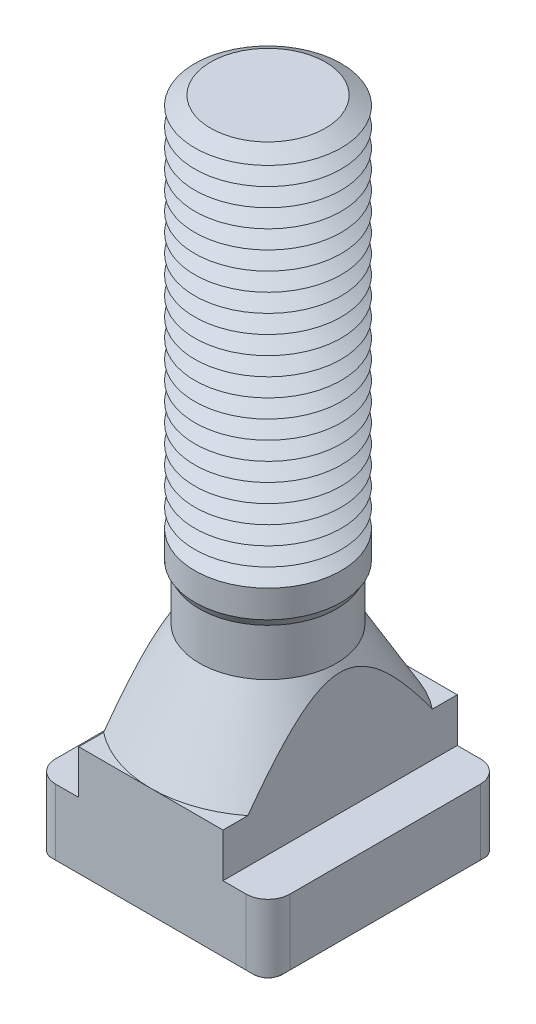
ISO-10303-21;
HEADER;
FILE_DESCRIPTION(('STEP AP214'),'2;1');
FILE_NAME('part.step','',(''),(''),'','','');
FILE_SCHEMA(('AUTOMOTIVE_DESIGN { 1 0 10303 214 1 1 1 1 }'));
ENDSEC;
DATA;
#1=APPLICATION_CONTEXT('core data for automotive mechanical design processes');
#2=APPLICATION_PROTOCOL_DEFINITION('international standard','automotive_design',2000,#1);
#3=PRODUCT_CONTEXT('',#1,'mechanical');
#4=PRODUCT('Part','Part','',(#3));
#5=PRODUCT_RELATED_PRODUCT_CATEGORY('part','',(#4));
#6=PRODUCT_DEFINITION_FORMATION('','',#4);
#7=PRODUCT_DEFINITION_CONTEXT('part definition',#1,'design');
#8=PRODUCT_DEFINITION('design','',#6,#7);
#9=PRODUCT_DEFINITION_SHAPE('','',#8);
#10=(LENGTH_UNIT() NAMED_UNIT(*) SI_UNIT(.MILLI.,.METRE.));
#11=(NAMED_UNIT(*) PLANE_ANGLE_UNIT() SI_UNIT($,.RADIAN.));
#12=(NAMED_UNIT(*) SI_UNIT($,.STERADIAN.) SOLID_ANGLE_UNIT());
#13=UNCERTAINTY_MEASURE_WITH_UNIT(LENGTH_MEASURE(1.E-05),#10,'distance_accuracy_value','');
#14=(GEOMETRIC_REPRESENTATION_CONTEXT(3) GLOBAL_UNCERTAINTY_ASSIGNED_CONTEXT((#13)) GLOBAL_UNIT_ASSIGNED_CONTEXT((#10,
#11,#12)) REPRESENTATION_CONTEXT('',''));
#15=CARTESIAN_POINT('',(0.,0.,0.));
#16=DIRECTION('',(0.,0.,1.));
#17=DIRECTION('',(1.,0.,0.));
#18=AXIS2_PLACEMENT_3D('',#15,#16,#17);
#19=CARTESIAN_POINT('',(0.,82.,0.));
#20=DIRECTION('',(0.,-1.,0.));
#21=DIRECTION('',(0.,0.,-1.));
#22=AXIS2_PLACEMENT_3D('',#19,#20,#21);
#23=CONICAL_SURFACE('',#22,7.83493649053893,1.04719755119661);
#24=CARTESIAN_POINT('',(0.,80.7500000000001,0.));
#25=DIRECTION('',(0.,-1.,0.));
#26=DIRECTION('',(0.,0.,-1.));
#27=AXIS2_PLACEMENT_3D('',#24,#25,#26);
#28=CIRCLE('',#27,10.);
#29=CARTESIAN_POINT('',(0.,80.7500000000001,-10.));
#30=VERTEX_POINT('',#29);
#31=EDGE_CURVE('E678',#30,#30,#28,.T.);
#32=ORIENTED_EDGE('',*,*,#31,.F.);
#33=EDGE_LOOP('',(#32));
#34=FACE_BOUND('',#33,.T.);
#35=CARTESIAN_POINT('',(0.,82.,0.));
#36=DIRECTION('',(0.,-1.,0.));
#37=DIRECTION('',(0.,0.,-1.));
#38=AXIS2_PLACEMENT_3D('',#35,#36,#37);
#39=CIRCLE('',#38,7.83493649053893);
#40=CARTESIAN_POINT('',(0.,82.,-7.83493649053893));
#41=VERTEX_POINT('',#40);
#42=EDGE_CURVE('E675',#41,#41,#39,.T.);
#43=ORIENTED_EDGE('',*,*,#42,.T.);
#44=EDGE_LOOP('',(#43));
#45=FACE_BOUND('',#44,.T.);
#46=ADVANCED_FACE('F39',(#34,#45),#23,.T.);
#47=CARTESIAN_POINT('',(0.,83.2500000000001,0.));
#48=DIRECTION('',(0.,1.,0.));
#49=DIRECTION('',(0.,0.,1.));
#50=AXIS2_PLACEMENT_3D('',#47,#48,#49);
#51=CONICAL_SURFACE('',#50,10.,1.04719755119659);
#52=ORIENTED_EDGE('',*,*,#42,.F.);
#53=EDGE_LOOP('',(#52));
#54=FACE_BOUND('',#53,.T.);
#55=CARTESIAN_POINT('',(0.,83.2500000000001,0.));
#56=DIRECTION('',(0.,-1.,0.));
#57=DIRECTION('',(0.,0.,-1.));
#58=AXIS2_PLACEMENT_3D('',#55,#56,#57);
#59=CIRCLE('',#58,10.);
#60=CARTESIAN_POINT('',(0.,83.2500000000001,-10.));
#61=VERTEX_POINT('',#60);
#62=EDGE_CURVE('E644',#61,#61,#59,.T.);
#63=ORIENTED_EDGE('',*,*,#62,.T.);
#64=EDGE_LOOP('',(#63));
#65=FACE_BOUND('',#64,.T.);
#66=ADVANCED_FACE('F449',(#54,#65),#51,.T.);
#67=CARTESIAN_POINT('',(4.43896849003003,92.,0.));
#68=DIRECTION('',(0.,-1.,0.));
#69=DIRECTION('',(1.,0.,0.));
#70=AXIS2_PLACEMENT_3D('',#67,#68,#69);
#71=PLANE('',#70);
#72=CARTESIAN_POINT('',(0.,92.,0.));
#73=DIRECTION('',(0.,-1.,0.));
#74=DIRECTION('',(0.,0.,-1.));
#75=AXIS2_PLACEMENT_3D('',#72,#73,#74);
#76=CIRCLE('',#75,7.83493649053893);
#77=CARTESIAN_POINT('',(0.,92.,-7.83493649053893));
#78=VERTEX_POINT('',#77);
#79=EDGE_CURVE('E646',#78,#78,#76,.T.);
#80=ORIENTED_EDGE('',*,*,#79,.F.);
#81=EDGE_LOOP('',(#80));
#82=FACE_BOUND('',#81,.T.);
#83=ADVANCED_FACE('F455',(#82),#71,.F.);
#84=CARTESIAN_POINT('',(0.,92.,0.));
#85=DIRECTION('',(0.,-1.,0.));
#86=DIRECTION('',(0.,0.,-1.));
#87=AXIS2_PLACEMENT_3D('',#84,#85,#86);
#88=CONICAL_SURFACE('',#87,7.83493649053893,1.04719755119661);
#89=CARTESIAN_POINT('',(0.,90.7500000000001,0.));
#90=DIRECTION('',(0.,-1.,0.));
#91=DIRECTION('',(0.,0.,-1.));
#92=AXIS2_PLACEMENT_3D('',#89,#90,#91);
#93=CIRCLE('',#92,10.);
#94=CARTESIAN_POINT('',(0.,90.7500000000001,-10.));
#95=VERTEX_POINT('',#94);
#96=EDGE_CURVE('E649',#95,#95,#93,.T.);
#97=ORIENTED_EDGE('',*,*,#96,.F.);
#98=EDGE_LOOP('',(#97));
#99=FACE_BOUND('',#98,.T.);
#100=ORIENTED_EDGE('',*,*,#79,.T.);
#101=EDGE_LOOP('',(#100));
#102=FACE_BOUND('',#101,.T.);
#103=ADVANCED_FACE('F483',(#99,#102),#88,.T.);
#104=CARTESIAN_POINT('',(0.,90.7500000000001,0.));
#105=DIRECTION('',(0.,1.,0.));
#106=DIRECTION('',(0.,0.,1.));
#107=AXIS2_PLACEMENT_3D('',#104,#105,#106);
#108=CONICAL_SURFACE('',#107,10.,1.04719755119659);
#109=CARTESIAN_POINT('',(0.,89.5,0.));
#110=DIRECTION('',(0.,-1.,0.));
#111=DIRECTION('',(0.,0.,-1.));
#112=AXIS2_PLACEMENT_3D('',#109,#110,#111);
#113=CIRCLE('',#112,7.83493649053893);
#114=CARTESIAN_POINT('',(0.,89.5,-7.83493649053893));
#115=VERTEX_POINT('',#114);
#116=EDGE_CURVE('E670',#115,#115,#113,.T.);
#117=ORIENTED_EDGE('',*,*,#116,.F.);
#118=EDGE_LOOP('',(#117));
#119=FACE_BOUND('',#118,.T.);
#120=ORIENTED_EDGE('',*,*,#96,.T.);
#121=EDGE_LOOP('',(#120));
#122=FACE_BOUND('',#121,.T.);
#123=ADVANCED_FACE('F480',(#119,#122),#108,.T.);
#124=CARTESIAN_POINT('',(0.,89.5,0.));
#125=DIRECTION('',(0.,-1.,0.));
#126=DIRECTION('',(0.,0.,-1.));
#127=AXIS2_PLACEMENT_3D('',#124,#125,#126);
#128=CONICAL_SURFACE('',#127,7.83493649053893,1.04719755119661);
#129=CARTESIAN_POINT('',(0.,88.2500000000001,0.));
#130=DIRECTION('',(0.,-1.,0.));
#131=DIRECTION('',(0.,0.,-1.));
#132=AXIS2_PLACEMENT_3D('',#129,#130,#131);
#133=CIRCLE('',#132,10.);
#134=CARTESIAN_POINT('',(0.,88.2500000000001,-10.));
#135=VERTEX_POINT('',#134);
#136=EDGE_CURVE('E673',#135,#135,#133,.T.);
#137=ORIENTED_EDGE('',*,*,#136,.F.);
#138=EDGE_LOOP('',(#137));
#139=FACE_BOUND('',#138,.T.);
#140=ORIENTED_EDGE('',*,*,#116,.T.);
#141=EDGE_LOOP('',(#140));
#142=FACE_BOUND('',#141,.T.);
#143=ADVANCED_FACE('F475',(#139,#142),#128,.T.);
#144=CARTESIAN_POINT('',(0.,88.2500000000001,0.));
#145=DIRECTION('',(0.,1.,0.));
#146=DIRECTION('',(0.,0.,1.));
#147=AXIS2_PLACEMENT_3D('',#144,#145,#146);
#148=CONICAL_SURFACE('',#147,10.,1.04719755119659);
#149=CARTESIAN_POINT('',(0.,87.,0.));
#150=DIRECTION('',(0.,-1.,0.));
#151=DIRECTION('',(0.,0.,-1.));
#152=AXIS2_PLACEMENT_3D('',#149,#150,#151);
#153=CIRCLE('',#152,7.83493649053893);
#154=CARTESIAN_POINT('',(0.,87.,-7.83493649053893));
#155=VERTEX_POINT('',#154);
#156=EDGE_CURVE('E762',#155,#155,#153,.T.);
#157=ORIENTED_EDGE('',*,*,#156,.F.);
#158=EDGE_LOOP('',(#157));
#159=FACE_BOUND('',#158,.T.);
#160=ORIENTED_EDGE('',*,*,#136,.T.);
#161=EDGE_LOOP('',(#160));
#162=FACE_BOUND('',#161,.T.);
#163=ADVANCED_FACE('F472',(#159,#162),#148,.T.);
#164=CARTESIAN_POINT('',(0.,87.,0.));
#165=DIRECTION('',(0.,-1.,0.));
#166=DIRECTION('',(0.,0.,-1.));
#167=AXIS2_PLACEMENT_3D('',#164,#165,#166);
#168=CONICAL_SURFACE('',#167,7.83493649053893,1.04719755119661);
#169=CARTESIAN_POINT('',(0.,85.75,0.));
#170=DIRECTION('',(0.,-1.,0.));
#171=DIRECTION('',(0.,0.,-1.));
#172=AXIS2_PLACEMENT_3D('',#169,#170,#171);
#173=CIRCLE('',#172,10.);
#174=CARTESIAN_POINT('',(0.,85.75,-10.));
#175=VERTEX_POINT('',#174);
#176=EDGE_CURVE('E643',#175,#175,#173,.T.);
#177=ORIENTED_EDGE('',*,*,#176,.F.);
#178=EDGE_LOOP('',(#177));
#179=FACE_BOUND('',#178,.T.);
#180=ORIENTED_EDGE('',*,*,#156,.T.);
#181=EDGE_LOOP('',(#180));
#182=FACE_BOUND('',#181,.T.);
#183=ADVANCED_FACE('F466',(#179,#182),#168,.T.);
#184=CARTESIAN_POINT('',(0.,85.75,0.));
#185=DIRECTION('',(0.,1.,0.));
#186=DIRECTION('',(0.,0.,1.));
#187=AXIS2_PLACEMENT_3D('',#184,#185,#186);
#188=CONICAL_SURFACE('',#187,10.,1.04719755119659);
#189=CARTESIAN_POINT('',(0.,84.5,0.));
#190=DIRECTION('',(0.,-1.,0.));
#191=DIRECTION('',(0.,0.,-1.));
#192=AXIS2_PLACEMENT_3D('',#189,#190,#191);
#193=CIRCLE('',#192,7.83493649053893);
#194=CARTESIAN_POINT('',(0.,84.5,-7.83493649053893));
#195=VERTEX_POINT('',#194);
#196=EDGE_CURVE('E640',#195,#195,#193,.T.);
#197=ORIENTED_EDGE('',*,*,#196,.F.);
#198=EDGE_LOOP('',(#197));
#199=FACE_BOUND('',#198,.T.);
#200=ORIENTED_EDGE('',*,*,#176,.T.);
#201=EDGE_LOOP('',(#200));
#202=FACE_BOUND('',#201,.T.);
#203=ADVANCED_FACE('F462',(#199,#202),#188,.T.);
#204=CARTESIAN_POINT('',(0.,84.5,0.));
#205=DIRECTION('',(0.,-1.,0.));
#206=DIRECTION('',(0.,0.,-1.));
#207=AXIS2_PLACEMENT_3D('',#204,#205,#206);
#208=CONICAL_SURFACE('',#207,7.83493649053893,1.04719755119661);
#209=ORIENTED_EDGE('',*,*,#62,.F.);
#210=EDGE_LOOP('',(#209));
#211=FACE_BOUND('',#210,.T.);
#212=ORIENTED_EDGE('',*,*,#196,.T.);
#213=EDGE_LOOP('',(#212));
#214=FACE_BOUND('',#213,.T.);
#215=ADVANCED_FACE('F465',(#211,#214),#208,.T.);
#216=CARTESIAN_POINT('',(0.,79.5,0.));
#217=DIRECTION('',(0.,-1.,0.));
#218=DIRECTION('',(0.,0.,-1.));
#219=AXIS2_PLACEMENT_3D('',#216,#217,#218);
#220=CONICAL_SURFACE('',#219,7.83493649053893,1.04719755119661);
#221=CARTESIAN_POINT('',(0.,78.2500000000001,0.));
#222=DIRECTION('',(0.,-1.,0.));
#223=DIRECTION('',(0.,0.,-1.));
#224=AXIS2_PLACEMENT_3D('',#221,#222,#223);
#225=CIRCLE('',#224,10.);
#226=CARTESIAN_POINT('',(0.,78.2500000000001,-10.));
#227=VERTEX_POINT('',#226);
#228=EDGE_CURVE('E746',#227,#227,#225,.T.);
#229=ORIENTED_EDGE('',*,*,#228,.F.);
#230=EDGE_LOOP('',(#229));
#231=FACE_BOUND('',#230,.T.);
#232=CARTESIAN_POINT('',(0.,79.5,0.));
#233=DIRECTION('',(0.,-1.,0.));
#234=DIRECTION('',(0.,0.,-1.));
#235=AXIS2_PLACEMENT_3D('',#232,#233,#234);
#236=CIRCLE('',#235,7.83493649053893);
#237=CARTESIAN_POINT('',(0.,79.5,-7.83493649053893));
#238=VERTEX_POINT('',#237);
#239=EDGE_CURVE('E750',#238,#238,#236,.T.);
#240=ORIENTED_EDGE('',*,*,#239,.T.);
#241=EDGE_LOOP('',(#240));
#242=FACE_BOUND('',#241,.T.);
#243=ADVANCED_FACE('F470',(#231,#242),#220,.T.);
#244=CARTESIAN_POINT('',(0.,80.7500000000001,0.));
#245=DIRECTION('',(0.,1.,0.));
#246=DIRECTION('',(0.,0.,1.));
#247=AXIS2_PLACEMENT_3D('',#244,#245,#246);
#248=CONICAL_SURFACE('',#247,10.,1.04719755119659);
#249=ORIENTED_EDGE('',*,*,#239,.F.);
#250=EDGE_LOOP('',(#249));
#251=FACE_BOUND('',#250,.T.);
#252=ORIENTED_EDGE('',*,*,#31,.T.);
#253=EDGE_LOOP('',(#252));
#254=FACE_BOUND('',#253,.T.);
#255=ADVANCED_FACE('F1217',(#251,#254),#248,.T.);
#256=CARTESIAN_POINT('',(0.,77.,0.));
#257=DIRECTION('',(0.,-1.,0.));
#258=DIRECTION('',(0.,0.,-1.));
#259=AXIS2_PLACEMENT_3D('',#256,#257,#258);
#260=CONICAL_SURFACE('',#259,7.83493649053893,1.04719755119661);
#261=CARTESIAN_POINT('',(0.,75.7500000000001,0.));
#262=DIRECTION('',(0.,-1.,0.));
#263=DIRECTION('',(0.,0.,-1.));
#264=AXIS2_PLACEMENT_3D('',#261,#262,#263);
#265=CIRCLE('',#264,10.);
#266=CARTESIAN_POINT('',(0.,75.7500000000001,-10.));
#267=VERTEX_POINT('',#266);
#268=EDGE_CURVE('E738',#267,#267,#265,.T.);
#269=ORIENTED_EDGE('',*,*,#268,.F.);
#270=EDGE_LOOP('',(#269));
#271=FACE_BOUND('',#270,.T.);
#272=CARTESIAN_POINT('',(0.,77.,0.));
#273=DIRECTION('',(0.,-1.,0.));
#274=DIRECTION('',(0.,0.,-1.));
#275=AXIS2_PLACEMENT_3D('',#272,#273,#274);
#276=CIRCLE('',#275,7.83493649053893);
#277=CARTESIAN_POINT('',(0.,77.,-7.83493649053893));
#278=VERTEX_POINT('',#277);
#279=EDGE_CURVE('E742',#278,#278,#276,.T.);
#280=ORIENTED_EDGE('',*,*,#279,.T.);
#281=EDGE_LOOP('',(#280));
#282=FACE_BOUND('',#281,.T.);
#283=ADVANCED_FACE('F1207',(#271,#282),#260,.T.);
#284=CARTESIAN_POINT('',(0.,78.2500000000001,0.));
#285=DIRECTION('',(0.,1.,0.));
#286=DIRECTION('',(0.,0.,1.));
#287=AXIS2_PLACEMENT_3D('',#284,#285,#286);
#288=CONICAL_SURFACE('',#287,10.,1.04719755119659);
#289=ORIENTED_EDGE('',*,*,#279,.F.);
#290=EDGE_LOOP('',(#289));
#291=FACE_BOUND('',#290,.T.);
#292=ORIENTED_EDGE('',*,*,#228,.T.);
#293=EDGE_LOOP('',(#292));
#294=FACE_BOUND('',#293,.T.);
#295=ADVANCED_FACE('F1197',(#291,#294),#288,.T.);
#296=CARTESIAN_POINT('',(0.,74.5,0.));
#297=DIRECTION('',(0.,-1.,0.));
#298=DIRECTION('',(0.,0.,-1.));
#299=AXIS2_PLACEMENT_3D('',#296,#297,#298);
#300=CONICAL_SURFACE('',#299,7.83493649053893,1.04719755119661);
#301=CARTESIAN_POINT('',(0.,73.2500000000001,0.));
#302=DIRECTION('',(0.,-1.,0.));
#303=DIRECTION('',(0.,0.,-1.));
#304=AXIS2_PLACEMENT_3D('',#301,#302,#303);
#305=CIRCLE('',#304,10.);
#306=CARTESIAN_POINT('',(0.,73.2500000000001,-10.));
#307=VERTEX_POINT('',#306);
#308=EDGE_CURVE('E730',#307,#307,#305,.T.);
#309=ORIENTED_EDGE('',*,*,#308,.F.);
#310=EDGE_LOOP('',(#309));
#311=FACE_BOUND('',#310,.T.);
#312=CARTESIAN_POINT('',(0.,74.5,0.));
#313=DIRECTION('',(0.,-1.,0.));
#314=DIRECTION('',(0.,0.,-1.));
#315=AXIS2_PLACEMENT_3D('',#312,#313,#314);
#316=CIRCLE('',#315,7.83493649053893);
#317=CARTESIAN_POINT('',(0.,74.5,-7.83493649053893));
#318=VERTEX_POINT('',#317);
#319=EDGE_CURVE('E734',#318,#318,#316,.T.);
#320=ORIENTED_EDGE('',*,*,#319,.T.);
#321=EDGE_LOOP('',(#320));
#322=FACE_BOUND('',#321,.T.);
#323=ADVANCED_FACE('F1187',(#311,#322),#300,.T.);
#324=CARTESIAN_POINT('',(0.,75.7500000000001,0.));
#325=DIRECTION('',(0.,1.,0.));
#326=DIRECTION('',(0.,0.,1.));
#327=AXIS2_PLACEMENT_3D('',#324,#325,#326);
#328=CONICAL_SURFACE('',#327,10.,1.04719755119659);
#329=ORIENTED_EDGE('',*,*,#319,.F.);
#330=EDGE_LOOP('',(#329));
#331=FACE_BOUND('',#330,.T.);
#332=ORIENTED_EDGE('',*,*,#268,.T.);
#333=EDGE_LOOP('',(#332));
#334=FACE_BOUND('',#333,.T.);
#335=ADVANCED_FACE('F1177',(#331,#334),#328,.T.);
#336=CARTESIAN_POINT('',(0.,72.,0.));
#337=DIRECTION('',(0.,-1.,0.));
#338=DIRECTION('',(0.,0.,-1.));
#339=AXIS2_PLACEMENT_3D('',#336,#337,#338);
#340=CONICAL_SURFACE('',#339,7.83493649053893,1.04719755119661);
#341=CARTESIAN_POINT('',(0.,70.7500000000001,0.));
#342=DIRECTION('',(0.,-1.,0.));
#343=DIRECTION('',(0.,0.,-1.));
#344=AXIS2_PLACEMENT_3D('',#341,#342,#343);
#345=CIRCLE('',#344,10.);
#346=CARTESIAN_POINT('',(0.,70.7500000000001,-10.));
#347=VERTEX_POINT('',#346);
#348=EDGE_CURVE('E722',#347,#347,#345,.T.);
#349=ORIENTED_EDGE('',*,*,#348,.F.);
#350=EDGE_LOOP('',(#349));
#351=FACE_BOUND('',#350,.T.);
#352=CARTESIAN_POINT('',(0.,72.,0.));
#353=DIRECTION('',(0.,-1.,0.));
#354=DIRECTION('',(0.,0.,-1.));
#355=AXIS2_PLACEMENT_3D('',#352,#353,#354);
#356=CIRCLE('',#355,7.83493649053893);
#357=CARTESIAN_POINT('',(0.,72.,-7.83493649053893));
#358=VERTEX_POINT('',#357);
#359=EDGE_CURVE('E726',#358,#358,#356,.T.);
#360=ORIENTED_EDGE('',*,*,#359,.T.);
#361=EDGE_LOOP('',(#360));
#362=FACE_BOUND('',#361,.T.);
#363=ADVANCED_FACE('F1167',(#351,#362),#340,.T.);
#364=CARTESIAN_POINT('',(0.,73.2500000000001,0.));
#365=DIRECTION('',(0.,1.,0.));
#366=DIRECTION('',(0.,0.,1.));
#367=AXIS2_PLACEMENT_3D('',#364,#365,#366);
#368=CONICAL_SURFACE('',#367,10.,1.04719755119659);
#369=ORIENTED_EDGE('',*,*,#359,.F.);
#370=EDGE_LOOP('',(#369));
#371=FACE_BOUND('',#370,.T.);
#372=ORIENTED_EDGE('',*,*,#308,.T.);
#373=EDGE_LOOP('',(#372));
#374=FACE_BOUND('',#373,.T.);
#375=ADVANCED_FACE('F1157',(#371,#374),#368,.T.);
#376=CARTESIAN_POINT('',(0.,69.5,0.));
#377=DIRECTION('',(0.,-1.,0.));
#378=DIRECTION('',(0.,0.,-1.));
#379=AXIS2_PLACEMENT_3D('',#376,#377,#378);
#380=CONICAL_SURFACE('',#379,7.83493649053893,1.04719755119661);
#381=CARTESIAN_POINT('',(0.,68.2500000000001,0.));
#382=DIRECTION('',(0.,-1.,0.));
#383=DIRECTION('',(0.,0.,-1.));
#384=AXIS2_PLACEMENT_3D('',#381,#382,#383);
#385=CIRCLE('',#384,10.);
#386=CARTESIAN_POINT('',(0.,68.2500000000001,-10.));
#387=VERTEX_POINT('',#386);
#388=EDGE_CURVE('E667',#387,#387,#385,.T.);
#389=ORIENTED_EDGE('',*,*,#388,.F.);
#390=EDGE_LOOP('',(#389));
#391=FACE_BOUND('',#390,.T.);
#392=CARTESIAN_POINT('',(0.,69.5,0.));
#393=DIRECTION('',(0.,-1.,0.));
#394=DIRECTION('',(0.,0.,-1.));
#395=AXIS2_PLACEMENT_3D('',#392,#393,#394);
#396=CIRCLE('',#395,7.83493649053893);
#397=CARTESIAN_POINT('',(0.,69.5,-7.83493649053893));
#398=VERTEX_POINT('',#397);
#399=EDGE_CURVE('E718',#398,#398,#396,.T.);
#400=ORIENTED_EDGE('',*,*,#399,.T.);
#401=EDGE_LOOP('',(#400));
#402=FACE_BOUND('',#401,.T.);
#403=ADVANCED_FACE('F1147',(#391,#402),#380,.T.);
#404=CARTESIAN_POINT('',(0.,70.7500000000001,0.));
#405=DIRECTION('',(0.,1.,0.));
#406=DIRECTION('',(0.,0.,1.));
#407=AXIS2_PLACEMENT_3D('',#404,#405,#406);
#408=CONICAL_SURFACE('',#407,10.,1.04719755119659);
#409=ORIENTED_EDGE('',*,*,#399,.F.);
#410=EDGE_LOOP('',(#409));
#411=FACE_BOUND('',#410,.T.);
#412=ORIENTED_EDGE('',*,*,#348,.T.);
#413=EDGE_LOOP('',(#412));
#414=FACE_BOUND('',#413,.T.);
#415=ADVANCED_FACE('F1137',(#411,#414),#408,.T.);
#416=CARTESIAN_POINT('',(0.,67.,0.));
#417=DIRECTION('',(0.,-1.,0.));
#418=DIRECTION('',(0.,0.,-1.));
#419=AXIS2_PLACEMENT_3D('',#416,#417,#418);
#420=CONICAL_SURFACE('',#419,7.83493649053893,1.04719755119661);
#421=CARTESIAN_POINT('',(0.,65.7500000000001,0.));
#422=DIRECTION('',(0.,-1.,0.));
#423=DIRECTION('',(0.,0.,-1.));
#424=AXIS2_PLACEMENT_3D('',#421,#422,#423);
#425=CIRCLE('',#424,10.);
#426=CARTESIAN_POINT('',(0.,65.7500000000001,-10.));
#427=VERTEX_POINT('',#426);
#428=EDGE_CURVE('E668',#427,#427,#425,.T.);
#429=ORIENTED_EDGE('',*,*,#428,.F.);
#430=EDGE_LOOP('',(#429));
#431=FACE_BOUND('',#430,.T.);
#432=CARTESIAN_POINT('',(0.,67.,0.));
#433=DIRECTION('',(0.,-1.,0.));
#434=DIRECTION('',(0.,0.,-1.));
#435=AXIS2_PLACEMENT_3D('',#432,#433,#434);
#436=CIRCLE('',#435,7.83493649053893);
#437=CARTESIAN_POINT('',(0.,67.,-7.83493649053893));
#438=VERTEX_POINT('',#437);
#439=EDGE_CURVE('E664',#438,#438,#436,.T.);
#440=ORIENTED_EDGE('',*,*,#439,.T.);
#441=EDGE_LOOP('',(#440));
#442=FACE_BOUND('',#441,.T.);
#443=ADVANCED_FACE('F1127',(#431,#442),#420,.T.);
#444=CARTESIAN_POINT('',(0.,68.2500000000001,0.));
#445=DIRECTION('',(0.,1.,0.));
#446=DIRECTION('',(0.,0.,1.));
#447=AXIS2_PLACEMENT_3D('',#444,#445,#446);
#448=CONICAL_SURFACE('',#447,10.,1.04719755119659);
#449=ORIENTED_EDGE('',*,*,#439,.F.);
#450=EDGE_LOOP('',(#449));
#451=FACE_BOUND('',#450,.T.);
#452=ORIENTED_EDGE('',*,*,#388,.T.);
#453=EDGE_LOOP('',(#452));
#454=FACE_BOUND('',#453,.T.);
#455=ADVANCED_FACE('F1117',(#451,#454),#448,.T.);
#456=CARTESIAN_POINT('',(0.,64.5,0.));
#457=DIRECTION('',(0.,-1.,0.));
#458=DIRECTION('',(0.,0.,-1.));
#459=AXIS2_PLACEMENT_3D('',#456,#457,#458);
#460=CONICAL_SURFACE('',#459,7.83493649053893,1.04719755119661);
#461=CARTESIAN_POINT('',(0.,63.2500000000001,0.));
#462=DIRECTION('',(0.,-1.,0.));
#463=DIRECTION('',(0.,0.,-1.));
#464=AXIS2_PLACEMENT_3D('',#461,#462,#463);
#465=CIRCLE('',#464,10.);
#466=CARTESIAN_POINT('',(0.,63.2500000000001,-10.));
#467=VERTEX_POINT('',#466);
#468=EDGE_CURVE('E697',#467,#467,#465,.T.);
#469=ORIENTED_EDGE('',*,*,#468,.F.);
#470=EDGE_LOOP('',(#469));
#471=FACE_BOUND('',#470,.T.);
#472=CARTESIAN_POINT('',(0.,64.5,0.));
#473=DIRECTION('',(0.,-1.,0.));
#474=DIRECTION('',(0.,0.,-1.));
#475=AXIS2_PLACEMENT_3D('',#472,#473,#474);
#476=CIRCLE('',#475,7.83493649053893);
#477=CARTESIAN_POINT('',(0.,64.5,-7.83493649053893));
#478=VERTEX_POINT('',#477);
#479=EDGE_CURVE('E699',#478,#478,#476,.T.);
#480=ORIENTED_EDGE('',*,*,#479,.T.);
#481=EDGE_LOOP('',(#480));
#482=FACE_BOUND('',#481,.T.);
#483=ADVANCED_FACE('F1107',(#471,#482),#460,.T.);
#484=CARTESIAN_POINT('',(0.,65.7500000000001,0.));
#485=DIRECTION('',(0.,1.,0.));
#486=DIRECTION('',(0.,0.,1.));
#487=AXIS2_PLACEMENT_3D('',#484,#485,#486);
#488=CONICAL_SURFACE('',#487,10.,1.04719755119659);
#489=ORIENTED_EDGE('',*,*,#479,.F.);
#490=EDGE_LOOP('',(#489));
#491=FACE_BOUND('',#490,.T.);
#492=ORIENTED_EDGE('',*,*,#428,.T.);
#493=EDGE_LOOP('',(#492));
#494=FACE_BOUND('',#493,.T.);
#495=ADVANCED_FACE('F1097',(#491,#494),#488,.T.);
#496=CARTESIAN_POINT('',(0.,62.,0.));
#497=DIRECTION('',(0.,-1.,0.));
#498=DIRECTION('',(0.,0.,-1.));
#499=AXIS2_PLACEMENT_3D('',#496,#497,#498);
#500=CONICAL_SURFACE('',#499,7.83493649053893,1.04719755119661);
#501=CARTESIAN_POINT('',(0.,60.7500000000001,0.));
#502=DIRECTION('',(0.,-1.,0.));
#503=DIRECTION('',(0.,0.,-1.));
#504=AXIS2_PLACEMENT_3D('',#501,#502,#503);
#505=CIRCLE('',#504,10.);
#506=CARTESIAN_POINT('',(0.,60.7500000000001,-10.));
#507=VERTEX_POINT('',#506);
#508=EDGE_CURVE('E695',#507,#507,#505,.T.);
#509=ORIENTED_EDGE('',*,*,#508,.F.);
#510=EDGE_LOOP('',(#509));
#511=FACE_BOUND('',#510,.T.);
#512=CARTESIAN_POINT('',(0.,62.,0.));
#513=DIRECTION('',(0.,-1.,0.));
#514=DIRECTION('',(0.,0.,-1.));
#515=AXIS2_PLACEMENT_3D('',#512,#513,#514);
#516=CIRCLE('',#515,7.83493649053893);
#517=CARTESIAN_POINT('',(0.,62.,-7.83493649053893));
#518=VERTEX_POINT('',#517);
#519=EDGE_CURVE('E700',#518,#518,#516,.T.);
#520=ORIENTED_EDGE('',*,*,#519,.T.);
#521=EDGE_LOOP('',(#520));
#522=FACE_BOUND('',#521,.T.);
#523=ADVANCED_FACE('F1087',(#511,#522),#500,.T.);
#524=CARTESIAN_POINT('',(0.,63.2500000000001,0.));
#525=DIRECTION('',(0.,1.,0.));
#526=DIRECTION('',(0.,0.,1.));
#527=AXIS2_PLACEMENT_3D('',#524,#525,#526);
#528=CONICAL_SURFACE('',#527,10.,1.04719755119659);
#529=ORIENTED_EDGE('',*,*,#519,.F.);
#530=EDGE_LOOP('',(#529));
#531=FACE_BOUND('',#530,.T.);
#532=ORIENTED_EDGE('',*,*,#468,.T.);
#533=EDGE_LOOP('',(#532));
#534=FACE_BOUND('',#533,.T.);
#535=ADVANCED_FACE('F1077',(#531,#534),#528,.T.);
#536=CARTESIAN_POINT('',(0.,59.5,0.));
#537=DIRECTION('',(0.,-1.,0.));
#538=DIRECTION('',(0.,0.,-1.));
#539=AXIS2_PLACEMENT_3D('',#536,#537,#538);
#540=CONICAL_SURFACE('',#539,7.83493649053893,1.04719755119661);
#541=CARTESIAN_POINT('',(0.,58.25,0.));
#542=DIRECTION('',(0.,-1.,0.));
#543=DIRECTION('',(0.,0.,-1.));
#544=AXIS2_PLACEMENT_3D('',#541,#542,#543);
#545=CIRCLE('',#544,10.);
#546=CARTESIAN_POINT('',(0.,58.25,-10.));
#547=VERTEX_POINT('',#546);
#548=EDGE_CURVE('E658',#547,#547,#545,.T.);
#549=ORIENTED_EDGE('',*,*,#548,.F.);
#550=EDGE_LOOP('',(#549));
#551=FACE_BOUND('',#550,.T.);
#552=CARTESIAN_POINT('',(0.,59.5,0.));
#553=DIRECTION('',(0.,-1.,0.));
#554=DIRECTION('',(0.,0.,-1.));
#555=AXIS2_PLACEMENT_3D('',#552,#553,#554);
#556=CIRCLE('',#555,7.83493649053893);
#557=CARTESIAN_POINT('',(0.,59.5,-7.83493649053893));
#558=VERTEX_POINT('',#557);
#559=EDGE_CURVE('E661',#558,#558,#556,.T.);
#560=ORIENTED_EDGE('',*,*,#559,.T.);
#561=EDGE_LOOP('',(#560));
#562=FACE_BOUND('',#561,.T.);
#563=ADVANCED_FACE('F1067',(#551,#562),#540,.T.);
#564=CARTESIAN_POINT('',(0.,60.7500000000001,0.));
#565=DIRECTION('',(0.,1.,0.));
#566=DIRECTION('',(0.,0.,1.));
#567=AXIS2_PLACEMENT_3D('',#564,#565,#566);
#568=CONICAL_SURFACE('',#567,10.,1.04719755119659);
#569=ORIENTED_EDGE('',*,*,#559,.F.);
#570=EDGE_LOOP('',(#569));
#571=FACE_BOUND('',#570,.T.);
#572=ORIENTED_EDGE('',*,*,#508,.T.);
#573=EDGE_LOOP('',(#572));
#574=FACE_BOUND('',#573,.T.);
#575=ADVANCED_FACE('F1057',(#571,#574),#568,.T.);
#576=CARTESIAN_POINT('',(0.,57.,0.));
#577=DIRECTION('',(0.,-1.,0.));
#578=DIRECTION('',(0.,0.,-1.));
#579=AXIS2_PLACEMENT_3D('',#576,#577,#578);
#580=CONICAL_SURFACE('',#579,7.83493649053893,1.04719755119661);
#581=CARTESIAN_POINT('',(0.,55.7500000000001,0.));
#582=DIRECTION('',(0.,-1.,0.));
#583=DIRECTION('',(0.,0.,-1.));
#584=AXIS2_PLACEMENT_3D('',#581,#582,#583);
#585=CIRCLE('',#584,10.);
#586=CARTESIAN_POINT('',(0.,55.7500000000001,-10.));
#587=VERTEX_POINT('',#586);
#588=EDGE_CURVE('E1459',#587,#587,#585,.T.);
#589=ORIENTED_EDGE('',*,*,#588,.F.);
#590=EDGE_LOOP('',(#589));
#591=FACE_BOUND('',#590,.T.);
#592=CARTESIAN_POINT('',(0.,57.,0.));
#593=DIRECTION('',(0.,-1.,0.));
#594=DIRECTION('',(0.,0.,-1.));
#595=AXIS2_PLACEMENT_3D('',#592,#593,#594);
#596=CIRCLE('',#595,7.83493649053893);
#597=CARTESIAN_POINT('',(0.,57.,-7.83493649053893));
#598=VERTEX_POINT('',#597);
#599=EDGE_CURVE('E662',#598,#598,#596,.T.);
#600=ORIENTED_EDGE('',*,*,#599,.T.);
#601=EDGE_LOOP('',(#600));
#602=FACE_BOUND('',#601,.T.);
#603=ADVANCED_FACE('F1047',(#591,#602),#580,.T.);
#604=CARTESIAN_POINT('',(0.,58.25,0.));
#605=DIRECTION('',(0.,1.,0.));
#606=DIRECTION('',(0.,0.,1.));
#607=AXIS2_PLACEMENT_3D('',#604,#605,#606);
#608=CONICAL_SURFACE('',#607,10.,1.04719755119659);
#609=ORIENTED_EDGE('',*,*,#599,.F.);
#610=EDGE_LOOP('',(#609));
#611=FACE_BOUND('',#610,.T.);
#612=ORIENTED_EDGE('',*,*,#548,.T.);
#613=EDGE_LOOP('',(#612));
#614=FACE_BOUND('',#613,.T.);
#615=ADVANCED_FACE('F1037',(#611,#614),#608,.T.);
#616=CARTESIAN_POINT('',(0.,54.5,0.));
#617=DIRECTION('',(0.,-1.,0.));
#618=DIRECTION('',(0.,0.,-1.));
#619=AXIS2_PLACEMENT_3D('',#616,#617,#618);
#620=CONICAL_SURFACE('',#619,7.83493649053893,1.04719755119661);
#621=CARTESIAN_POINT('',(0.,53.2500000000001,0.));
#622=DIRECTION('',(0.,-1.,0.));
#623=DIRECTION('',(0.,0.,-1.));
#624=AXIS2_PLACEMENT_3D('',#621,#622,#623);
#625=CIRCLE('',#624,10.);
#626=CARTESIAN_POINT('',(0.,53.2500000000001,-10.));
#627=VERTEX_POINT('',#626);
#628=EDGE_CURVE('E690',#627,#627,#625,.T.);
#629=ORIENTED_EDGE('',*,*,#628,.F.);
#630=EDGE_LOOP('',(#629));
#631=FACE_BOUND('',#630,.T.);
#632=CARTESIAN_POINT('',(0.,54.5,0.));
#633=DIRECTION('',(0.,-1.,0.));
#634=DIRECTION('',(0.,0.,-1.));
#635=AXIS2_PLACEMENT_3D('',#632,#633,#634);
#636=CIRCLE('',#635,7.83493649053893);
#637=CARTESIAN_POINT('',(0.,54.5,-7.83493649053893));
#638=VERTEX_POINT('',#637);
#639=EDGE_CURVE('E781',#638,#638,#636,.T.);
#640=ORIENTED_EDGE('',*,*,#639,.T.);
#641=EDGE_LOOP('',(#640));
#642=FACE_BOUND('',#641,.T.);
#643=ADVANCED_FACE('F1027',(#631,#642),#620,.T.);
#644=CARTESIAN_POINT('',(0.,55.7500000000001,0.));
#645=DIRECTION('',(0.,1.,0.));
#646=DIRECTION('',(0.,0.,1.));
#647=AXIS2_PLACEMENT_3D('',#644,#645,#646);
#648=CONICAL_SURFACE('',#647,10.,1.04719755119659);
#649=ORIENTED_EDGE('',*,*,#639,.F.);
#650=EDGE_LOOP('',(#649));
#651=FACE_BOUND('',#650,.T.);
#652=ORIENTED_EDGE('',*,*,#588,.T.);
#653=EDGE_LOOP('',(#652));
#654=FACE_BOUND('',#653,.T.);
#655=ADVANCED_FACE('F1017',(#651,#654),#648,.T.);
#656=CARTESIAN_POINT('',(0.,52.,0.));
#657=DIRECTION('',(0.,-1.,0.));
#658=DIRECTION('',(0.,0.,-1.));
#659=AXIS2_PLACEMENT_3D('',#656,#657,#658);
#660=CONICAL_SURFACE('',#659,7.83493649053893,1.04719755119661);
#661=CARTESIAN_POINT('',(0.,50.75,0.));
#662=DIRECTION('',(0.,-1.,0.));
#663=DIRECTION('',(0.,0.,-1.));
#664=AXIS2_PLACEMENT_3D('',#661,#662,#663);
#665=CIRCLE('',#664,10.);
#666=CARTESIAN_POINT('',(0.,50.75,-10.));
#667=VERTEX_POINT('',#666);
#668=EDGE_CURVE('E691',#667,#667,#665,.T.);
#669=ORIENTED_EDGE('',*,*,#668,.F.);
#670=EDGE_LOOP('',(#669));
#671=FACE_BOUND('',#670,.T.);
#672=CARTESIAN_POINT('',(0.,52.,0.));
#673=DIRECTION('',(0.,-1.,0.));
#674=DIRECTION('',(0.,0.,-1.));
#675=AXIS2_PLACEMENT_3D('',#672,#673,#674);
#676=CIRCLE('',#675,7.83493649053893);
#677=CARTESIAN_POINT('',(0.,52.,-7.83493649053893));
#678=VERTEX_POINT('',#677);
#679=EDGE_CURVE('E688',#678,#678,#676,.T.);
#680=ORIENTED_EDGE('',*,*,#679,.T.);
#681=EDGE_LOOP('',(#680));
#682=FACE_BOUND('',#681,.T.);
#683=ADVANCED_FACE('F1007',(#671,#682),#660,.T.);
#684=CARTESIAN_POINT('',(0.,53.2500000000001,0.));
#685=DIRECTION('',(0.,1.,0.));
#686=DIRECTION('',(0.,0.,1.));
#687=AXIS2_PLACEMENT_3D('',#684,#685,#686);
#688=CONICAL_SURFACE('',#687,10.,1.04719755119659);
#689=ORIENTED_EDGE('',*,*,#679,.F.);
#690=EDGE_LOOP('',(#689));
#691=FACE_BOUND('',#690,.T.);
#692=ORIENTED_EDGE('',*,*,#628,.T.);
#693=EDGE_LOOP('',(#692));
#694=FACE_BOUND('',#693,.T.);
#695=ADVANCED_FACE('F997',(#691,#694),#688,.T.);
#696=CARTESIAN_POINT('',(0.,49.5,0.));
#697=DIRECTION('',(0.,-1.,0.));
#698=DIRECTION('',(0.,0.,-1.));
#699=AXIS2_PLACEMENT_3D('',#696,#697,#698);
#700=CONICAL_SURFACE('',#699,7.83493649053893,1.04719755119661);
#701=CARTESIAN_POINT('',(0.,48.2500000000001,0.));
#702=DIRECTION('',(0.,-1.,0.));
#703=DIRECTION('',(0.,0.,-1.));
#704=AXIS2_PLACEMENT_3D('',#701,#702,#703);
#705=CIRCLE('',#704,10.);
#706=CARTESIAN_POINT('',(0.,48.2500000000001,-10.));
#707=VERTEX_POINT('',#706);
#708=EDGE_CURVE('E652',#707,#707,#705,.T.);
#709=ORIENTED_EDGE('',*,*,#708,.F.);
#710=EDGE_LOOP('',(#709));
#711=FACE_BOUND('',#710,.T.);
#712=CARTESIAN_POINT('',(0.,49.5,0.));
#713=DIRECTION('',(0.,-1.,0.));
#714=DIRECTION('',(0.,0.,-1.));
#715=AXIS2_PLACEMENT_3D('',#712,#713,#714);
#716=CIRCLE('',#715,7.83493649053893);
#717=CARTESIAN_POINT('',(0.,49.5,-7.83493649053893));
#718=VERTEX_POINT('',#717);
#719=EDGE_CURVE('E655',#718,#718,#716,.T.);
#720=ORIENTED_EDGE('',*,*,#719,.T.);
#721=EDGE_LOOP('',(#720));
#722=FACE_BOUND('',#721,.T.);
#723=ADVANCED_FACE('F987',(#711,#722),#700,.T.);
#724=CARTESIAN_POINT('',(0.,50.75,0.));
#725=DIRECTION('',(0.,1.,0.));
#726=DIRECTION('',(0.,0.,1.));
#727=AXIS2_PLACEMENT_3D('',#724,#725,#726);
#728=CONICAL_SURFACE('',#727,10.,1.04719755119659);
#729=ORIENTED_EDGE('',*,*,#719,.F.);
#730=EDGE_LOOP('',(#729));
#731=FACE_BOUND('',#730,.T.);
#732=ORIENTED_EDGE('',*,*,#668,.T.);
#733=EDGE_LOOP('',(#732));
#734=FACE_BOUND('',#733,.T.);
#735=ADVANCED_FACE('F977',(#731,#734),#728,.T.);
#736=CARTESIAN_POINT('',(0.,47.,0.));
#737=DIRECTION('',(0.,-1.,0.));
#738=DIRECTION('',(0.,0.,-1.));
#739=AXIS2_PLACEMENT_3D('',#736,#737,#738);
#740=CONICAL_SURFACE('',#739,7.83493649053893,1.04719755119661);
#741=CARTESIAN_POINT('',(0.,45.7500000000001,0.));
#742=DIRECTION('',(0.,-1.,0.));
#743=DIRECTION('',(0.,0.,-1.));
#744=AXIS2_PLACEMENT_3D('',#741,#742,#743);
#745=CIRCLE('',#744,10.);
#746=CARTESIAN_POINT('',(0.,45.7500000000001,-10.));
#747=VERTEX_POINT('',#746);
#748=EDGE_CURVE('E787',#747,#747,#745,.T.);
#749=ORIENTED_EDGE('',*,*,#748,.F.);
#750=EDGE_LOOP('',(#749));
#751=FACE_BOUND('',#750,.T.);
#752=CARTESIAN_POINT('',(0.,47.,0.));
#753=DIRECTION('',(0.,-1.,0.));
#754=DIRECTION('',(0.,0.,-1.));
#755=AXIS2_PLACEMENT_3D('',#752,#753,#754);
#756=CIRCLE('',#755,7.83493649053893);
#757=CARTESIAN_POINT('',(0.,47.,-7.83493649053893));
#758=VERTEX_POINT('',#757);
#759=EDGE_CURVE('E656',#758,#758,#756,.T.);
#760=ORIENTED_EDGE('',*,*,#759,.T.);
#761=EDGE_LOOP('',(#760));
#762=FACE_BOUND('',#761,.T.);
#763=ADVANCED_FACE('F967',(#751,#762),#740,.T.);
#764=CARTESIAN_POINT('',(0.,48.2500000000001,0.));
#765=DIRECTION('',(0.,1.,0.));
#766=DIRECTION('',(0.,0.,1.));
#767=AXIS2_PLACEMENT_3D('',#764,#765,#766);
#768=CONICAL_SURFACE('',#767,10.,1.04719755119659);
#769=ORIENTED_EDGE('',*,*,#759,.F.);
#770=EDGE_LOOP('',(#769));
#771=FACE_BOUND('',#770,.T.);
#772=ORIENTED_EDGE('',*,*,#708,.T.);
#773=EDGE_LOOP('',(#772));
#774=FACE_BOUND('',#773,.T.);
#775=ADVANCED_FACE('F957',(#771,#774),#768,.T.);
#776=CARTESIAN_POINT('',(0.,44.5,0.));
#777=DIRECTION('',(0.,-1.,0.));
#778=DIRECTION('',(0.,0.,-1.));
#779=AXIS2_PLACEMENT_3D('',#776,#777,#778);
#780=CONICAL_SURFACE('',#779,7.83493649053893,1.04719755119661);
#781=CARTESIAN_POINT('',(0.,43.25,0.));
#782=DIRECTION('',(0.,-1.,0.));
#783=DIRECTION('',(0.,0.,-1.));
#784=AXIS2_PLACEMENT_3D('',#781,#782,#783);
#785=CIRCLE('',#784,10.);
#786=CARTESIAN_POINT('',(0.,43.25,-10.));
#787=VERTEX_POINT('',#786);
#788=EDGE_CURVE('E638',#787,#787,#785,.T.);
#789=ORIENTED_EDGE('',*,*,#788,.F.);
#790=EDGE_LOOP('',(#789));
#791=FACE_BOUND('',#790,.T.);
#792=CARTESIAN_POINT('',(0.,44.5,0.));
#793=DIRECTION('',(0.,-1.,0.));
#794=DIRECTION('',(0.,0.,-1.));
#795=AXIS2_PLACEMENT_3D('',#792,#793,#794);
#796=CIRCLE('',#795,7.83493649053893);
#797=CARTESIAN_POINT('',(0.,44.5,-7.83493649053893));
#798=VERTEX_POINT('',#797);
#799=EDGE_CURVE('E637',#798,#798,#796,.T.);
#800=ORIENTED_EDGE('',*,*,#799,.T.);
#801=EDGE_LOOP('',(#800));
#802=FACE_BOUND('',#801,.T.);
#803=ADVANCED_FACE('F947',(#791,#802),#780,.T.);
#804=CARTESIAN_POINT('',(0.,45.7500000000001,0.));
#805=DIRECTION('',(0.,1.,0.));
#806=DIRECTION('',(0.,0.,1.));
#807=AXIS2_PLACEMENT_3D('',#804,#805,#806);
#808=CONICAL_SURFACE('',#807,10.,1.04719755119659);
#809=ORIENTED_EDGE('',*,*,#799,.F.);
#810=EDGE_LOOP('',(#809));
#811=FACE_BOUND('',#810,.T.);
#812=ORIENTED_EDGE('',*,*,#748,.T.);
#813=EDGE_LOOP('',(#812));
#814=FACE_BOUND('',#813,.T.);
#815=ADVANCED_FACE('F937',(#811,#814),#808,.T.);
#816=CARTESIAN_POINT('',(0.,42.,0.));
#817=DIRECTION('',(0.,-1.,0.));
#818=DIRECTION('',(0.,0.,-1.));
#819=AXIS2_PLACEMENT_3D('',#816,#817,#818);
#820=CONICAL_SURFACE('',#819,7.83493649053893,1.04719755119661);
#821=CARTESIAN_POINT('',(0.,40.75,0.));
#822=DIRECTION('',(0.,-1.,0.));
#823=DIRECTION('',(0.,0.,-1.));
#824=AXIS2_PLACEMENT_3D('',#821,#822,#823);
#825=CIRCLE('',#824,10.);
#826=CARTESIAN_POINT('',(0.,40.75,-10.));
#827=VERTEX_POINT('',#826);
#828=EDGE_CURVE('E634',#827,#827,#825,.T.);
#829=ORIENTED_EDGE('',*,*,#828,.F.);
#830=EDGE_LOOP('',(#829));
#831=FACE_BOUND('',#830,.T.);
#832=CARTESIAN_POINT('',(0.,42.,0.));
#833=DIRECTION('',(0.,-1.,0.));
#834=DIRECTION('',(0.,0.,-1.));
#835=AXIS2_PLACEMENT_3D('',#832,#833,#834);
#836=CIRCLE('',#835,7.83493649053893);
#837=CARTESIAN_POINT('',(0.,42.,-7.83493649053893));
#838=VERTEX_POINT('',#837);
#839=EDGE_CURVE('E686',#838,#838,#836,.T.);
#840=ORIENTED_EDGE('',*,*,#839,.T.);
#841=EDGE_LOOP('',(#840));
#842=FACE_BOUND('',#841,.T.);
#843=ADVANCED_FACE('F567',(#831,#842),#820,.T.);
#844=CARTESIAN_POINT('',(0.,43.25,0.));
#845=DIRECTION('',(0.,1.,0.));
#846=DIRECTION('',(0.,0.,1.));
#847=AXIS2_PLACEMENT_3D('',#844,#845,#846);
#848=CONICAL_SURFACE('',#847,10.,1.04719755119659);
#849=ORIENTED_EDGE('',*,*,#839,.F.);
#850=EDGE_LOOP('',(#849));
#851=FACE_BOUND('',#850,.T.);
#852=ORIENTED_EDGE('',*,*,#788,.T.);
#853=EDGE_LOOP('',(#852));
#854=FACE_BOUND('',#853,.T.);
#855=ADVANCED_FACE('F562',(#851,#854),#848,.T.);
#856=CARTESIAN_POINT('',(-14.5857864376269,5.82842712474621,-14.5857864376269));
#857=DIRECTION('',(-0.577350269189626,0.577350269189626,-0.577350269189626));
#858=DIRECTION('',(-0.707106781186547,0.,0.707106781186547));
#859=AXIS2_PLACEMENT_3D('',#856,#857,#858);
#860=CYLINDRICAL_SURFACE('',#859,3.);
#861=CARTESIAN_POINT('',(-8.7573593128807,0.,-8.7573593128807));
#862=DIRECTION('',(0.,1.,0.));
#863=DIRECTION('',(-0.707106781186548,0.,-0.707106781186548));
#864=AXIS2_PLACEMENT_3D('',#861,#862,#863);
#865=ELLIPSE('',#864,5.19615242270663,3.);
#866=CARTESIAN_POINT('',(-13.,0.,-10.8786796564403));
#867=VERTEX_POINT('',#866);
#868=CARTESIAN_POINT('',(-10.8786796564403,0.,-13.));
#869=VERTEX_POINT('',#868);
#870=EDGE_CURVE('E326',#867,#869,#865,.F.);
#871=ORIENTED_EDGE('',*,*,#870,.F.);
#872=DIRECTION('',(0.577350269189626,-0.577350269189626,0.577350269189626));
#873=VECTOR('',#872,1.);
#874=CARTESIAN_POINT('',(-6.04044011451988,-6.9595598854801,-3.91911977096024));
#875=LINE('',#874,#873);
#876=CARTESIAN_POINT('',(-15.8977774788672,2.89777747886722,-13.7764571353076));
#877=VERTEX_POINT('',#876);
#878=EDGE_CURVE('E367',#877,#867,#875,.T.);
#879=ORIENTED_EDGE('',*,*,#878,.F.);
#880=CARTESIAN_POINT('',(-13.,4.2426406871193,-13.));
#881=DIRECTION('',(0.325057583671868,-0.888073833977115,0.325057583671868));
#882=DIRECTION('',(-0.627963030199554,-0.459700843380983,-0.627963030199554));
#883=AXIS2_PLACEMENT_3D('',#880,#881,#882);
#884=ELLIPSE('',#883,3.37809750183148,3.);
#885=CARTESIAN_POINT('',(-13.7764571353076,2.89777747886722,-15.8977774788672));
#886=VERTEX_POINT('',#885);
#887=EDGE_CURVE('E264',#877,#886,#884,.T.);
#888=ORIENTED_EDGE('',*,*,#887,.T.);
#889=DIRECTION('',(0.577350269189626,-0.577350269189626,0.577350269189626));
#890=VECTOR('',#889,1.);
#891=CARTESIAN_POINT('',(-14.5857864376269,3.70710678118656,-16.7071067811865));
#892=LINE('',#891,#890);
#893=EDGE_CURVE('E360',#869,#886,#892,.F.);
#894=ORIENTED_EDGE('',*,*,#893,.F.);
#895=EDGE_LOOP('',(#871,#879,#888,#894));
#896=FACE_BOUND('',#895,.T.);
#897=ADVANCED_FACE('F551',(#896),#860,.T.);
#898=CARTESIAN_POINT('',(3.91911977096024,-4.83823954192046,-3.91911977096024));
#899=DIRECTION('',(0.577350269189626,0.577350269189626,-0.577350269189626));
#900=DIRECTION('',(-0.707106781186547,0.,-0.707106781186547));
#901=AXIS2_PLACEMENT_3D('',#898,#899,#900);
#902=CYLINDRICAL_SURFACE('',#901,3.);
#903=CARTESIAN_POINT('',(8.7573593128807,0.,-8.75735931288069));
#904=DIRECTION('',(0.,1.,0.));
#905=DIRECTION('',(0.707106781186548,0.,-0.707106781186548));
#906=AXIS2_PLACEMENT_3D('',#903,#904,#905);
#907=ELLIPSE('',#906,5.19615242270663,3.);
#908=CARTESIAN_POINT('',(10.8786796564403,0.,-13.));
#909=VERTEX_POINT('',#908);
#910=CARTESIAN_POINT('',(13.,0.,-10.8786796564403));
#911=VERTEX_POINT('',#910);
#912=EDGE_CURVE('E332',#909,#911,#907,.F.);
#913=ORIENTED_EDGE('',*,*,#912,.F.);
#914=DIRECTION('',(-0.577350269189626,-0.577350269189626,0.577350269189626));
#915=VECTOR('',#914,1.);
#916=CARTESIAN_POINT('',(3.91911977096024,-6.9595598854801,-6.04044011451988));
#917=LINE('',#916,#915);
#918=CARTESIAN_POINT('',(13.7764571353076,2.89777747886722,-15.8977774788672));
#919=VERTEX_POINT('',#918);
#920=EDGE_CURVE('E354',#919,#909,#917,.T.);
#921=ORIENTED_EDGE('',*,*,#920,.F.);
#922=CARTESIAN_POINT('',(13.,4.2426406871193,-13.));
#923=DIRECTION('',(-0.325057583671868,-0.888073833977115,0.325057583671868));
#924=DIRECTION('',(0.627963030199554,-0.459700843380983,-0.627963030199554));
#925=AXIS2_PLACEMENT_3D('',#922,#923,#924);
#926=ELLIPSE('',#925,3.37809750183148,3.);
#927=CARTESIAN_POINT('',(15.8977774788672,2.89777747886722,-13.7764571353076));
#928=VERTEX_POINT('',#927);
#929=EDGE_CURVE('E407',#919,#928,#926,.T.);
#930=ORIENTED_EDGE('',*,*,#929,.T.);
#931=DIRECTION('',(-0.577350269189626,-0.577350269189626,0.577350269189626));
#932=VECTOR('',#931,1.);
#933=CARTESIAN_POINT('',(6.04044011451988,-6.9595598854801,-3.91911977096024));
#934=LINE('',#933,#932);
#935=EDGE_CURVE('E322',#911,#928,#934,.F.);
#936=ORIENTED_EDGE('',*,*,#935,.F.);
#937=EDGE_LOOP('',(#913,#921,#930,#936));
#938=FACE_BOUND('',#937,.T.);
#939=ADVANCED_FACE('F547',(#938),#902,.T.);
#940=CARTESIAN_POINT('',(16.,0.,-16.));
#941=DIRECTION('',(0.,1.,0.));
#942=DIRECTION('',(0.,0.,1.));
#943=AXIS2_PLACEMENT_3D('',#940,#941,#942);
#944=PLANE('',#943);
#945=DIRECTION('',(0.,0.,1.));
#946=VECTOR('',#945,1.);
#947=CARTESIAN_POINT('',(13.,0.,-16.));
#948=LINE('',#947,#946);
#949=CARTESIAN_POINT('',(13.,0.,10.8786796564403));
#950=VERTEX_POINT('',#949);
#951=EDGE_CURVE('E296',#911,#950,#948,.T.);
#952=ORIENTED_EDGE('',*,*,#951,.T.);
#953=CARTESIAN_POINT('',(8.7573593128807,0.,8.7573593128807));
#954=DIRECTION('',(0.,1.,0.));
#955=DIRECTION('',(-0.707106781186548,0.,-0.707106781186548));
#956=AXIS2_PLACEMENT_3D('',#953,#954,#955);
#957=ELLIPSE('',#956,5.19615242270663,3.);
#958=CARTESIAN_POINT('',(10.8786796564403,0.,13.));
#959=VERTEX_POINT('',#958);
#960=EDGE_CURVE('E335',#950,#959,#957,.F.);
#961=ORIENTED_EDGE('',*,*,#960,.T.);
#962=DIRECTION('',(-1.,0.,0.));
#963=VECTOR('',#962,1.);
#964=CARTESIAN_POINT('',(16.,0.,13.));
#965=LINE('',#964,#963);
#966=CARTESIAN_POINT('',(-10.8786796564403,0.,13.));
#967=VERTEX_POINT('',#966);
#968=EDGE_CURVE('E283',#959,#967,#965,.T.);
#969=ORIENTED_EDGE('',*,*,#968,.T.);
#970=CARTESIAN_POINT('',(-8.7573593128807,0.,8.7573593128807));
#971=DIRECTION('',(0.,1.,0.));
#972=DIRECTION('',(0.707106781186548,0.,-0.707106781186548));
#973=AXIS2_PLACEMENT_3D('',#970,#971,#972);
#974=ELLIPSE('',#973,5.19615242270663,3.);
#975=CARTESIAN_POINT('',(-13.,0.,10.8786796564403));
#976=VERTEX_POINT('',#975);
#977=EDGE_CURVE('E329',#967,#976,#974,.F.);
#978=ORIENTED_EDGE('',*,*,#977,.T.);
#979=DIRECTION('',(0.,0.,-1.));
#980=VECTOR('',#979,1.);
#981=CARTESIAN_POINT('',(-13.,0.,-16.));
#982=LINE('',#981,#980);
#983=EDGE_CURVE('E288',#976,#867,#982,.T.);
#984=ORIENTED_EDGE('',*,*,#983,.T.);
#985=ORIENTED_EDGE('',*,*,#870,.T.);
#986=DIRECTION('',(1.,0.,0.));
#987=VECTOR('',#986,1.);
#988=CARTESIAN_POINT('',(16.,0.,-13.));
#989=LINE('',#988,#987);
#990=EDGE_CURVE('E292',#869,#909,#989,.T.);
#991=ORIENTED_EDGE('',*,*,#990,.T.);
#992=ORIENTED_EDGE('',*,*,#912,.T.);
#993=EDGE_LOOP('',(#952,#961,#969,#978,#984,#985,#991,#992));
#994=FACE_BOUND('',#993,.T.);
#995=ADVANCED_FACE('F550',(#994),#944,.F.);
#996=CARTESIAN_POINT('',(-14.5857864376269,5.82842712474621,14.5857864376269));
#997=DIRECTION('',(0.577350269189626,-0.577350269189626,-0.577350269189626));
#998=DIRECTION('',(-0.707106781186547,0.,-0.707106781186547));
#999=AXIS2_PLACEMENT_3D('',#996,#997,#998);
#1000=CYLINDRICAL_SURFACE('',#999,3.);
#1001=CARTESIAN_POINT('',(-13.,4.2426406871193,13.));
#1002=DIRECTION('',(0.325057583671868,-0.888073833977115,-0.325057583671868));
#1003=DIRECTION('',(-0.627963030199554,-0.459700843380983,0.627963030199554));
#1004=AXIS2_PLACEMENT_3D('',#1001,#1002,#1003);
#1005=ELLIPSE('',#1004,3.37809750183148,3.);
#1006=CARTESIAN_POINT('',(-13.7764571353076,2.89777747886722,15.8977774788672));
#1007=VERTEX_POINT('',#1006);
#1008=CARTESIAN_POINT('',(-15.8977774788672,2.89777747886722,13.7764571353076));
#1009=VERTEX_POINT('',#1008);
#1010=EDGE_CURVE('E410',#1007,#1009,#1005,.T.);
#1011=ORIENTED_EDGE('',*,*,#1010,.T.);
#1012=DIRECTION('',(-0.577350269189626,0.577350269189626,0.577350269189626));
#1013=VECTOR('',#1012,1.);
#1014=CARTESIAN_POINT('',(-16.7071067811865,3.70710678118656,14.5857864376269));
#1015=LINE('',#1014,#1013);
#1016=EDGE_CURVE('E373',#976,#1009,#1015,.T.);
#1017=ORIENTED_EDGE('',*,*,#1016,.F.);
#1018=ORIENTED_EDGE('',*,*,#977,.F.);
#1019=DIRECTION('',(-0.577350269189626,0.577350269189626,0.577350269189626));
#1020=VECTOR('',#1019,1.);
#1021=CARTESIAN_POINT('',(-14.5857864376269,3.70710678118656,16.7071067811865));
#1022=LINE('',#1021,#1020);
#1023=EDGE_CURVE('E347',#1007,#967,#1022,.F.);
#1024=ORIENTED_EDGE('',*,*,#1023,.F.);
#1025=EDGE_LOOP('',(#1011,#1017,#1018,#1024));
#1026=FACE_BOUND('',#1025,.T.);
#1027=ADVANCED_FACE('F542',(#1026),#1000,.T.);
#1028=CARTESIAN_POINT('',(-16.,3.00000000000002,16.));
#1029=DIRECTION('',(0.707106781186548,0.707106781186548,0.));
#1030=DIRECTION('',(-0.707106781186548,0.707106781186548,0.));
#1031=AXIS2_PLACEMENT_3D('',#1028,#1029,#1030);
#1032=PLANE('',#1031);
#1033=ORIENTED_EDGE('',*,*,#983,.F.);
#1034=ORIENTED_EDGE('',*,*,#1016,.T.);
#1035=CARTESIAN_POINT('',(-13.,0.,13.));
#1036=DIRECTION('',(0.707106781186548,0.707106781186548,0.));
#1037=DIRECTION('',(0.707106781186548,-0.707106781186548,0.));
#1038=AXIS2_PLACEMENT_3D('',#1035,#1036,#1037);
#1039=ELLIPSE('',#1038,4.24264068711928,3.);
#1040=CARTESIAN_POINT('',(-16.,3.00000000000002,13.));
#1041=VERTEX_POINT('',#1040);
#1042=EDGE_CURVE('E370',#1009,#1041,#1039,.F.);
#1043=ORIENTED_EDGE('',*,*,#1042,.T.);
#1044=DIRECTION('',(0.,0.,1.));
#1045=VECTOR('',#1044,1.);
#1046=CARTESIAN_POINT('',(-16.,3.00000000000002,16.));
#1047=LINE('',#1046,#1045);
#1048=CARTESIAN_POINT('',(-16.,3.00000000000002,-13.));
#1049=VERTEX_POINT('',#1048);
#1050=EDGE_CURVE('E304',#1049,#1041,#1047,.T.);
#1051=ORIENTED_EDGE('',*,*,#1050,.F.);
#1052=CARTESIAN_POINT('',(-13.,0.,-13.));
#1053=DIRECTION('',(0.707106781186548,0.707106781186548,0.));
#1054=DIRECTION('',(0.707106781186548,-0.707106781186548,0.));
#1055=AXIS2_PLACEMENT_3D('',#1052,#1053,#1054);
#1056=ELLIPSE('',#1055,4.24264068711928,3.);
#1057=EDGE_CURVE('E364',#1049,#877,#1056,.F.);
#1058=ORIENTED_EDGE('',*,*,#1057,.T.);
#1059=ORIENTED_EDGE('',*,*,#878,.T.);
#1060=EDGE_LOOP('',(#1033,#1034,#1043,#1051,#1058,#1059));
#1061=FACE_BOUND('',#1060,.T.);
#1062=ADVANCED_FACE('F529',(#1061),#1032,.F.);
#1063=CARTESIAN_POINT('',(16.,3.00000000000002,16.));
#1064=DIRECTION('',(-0.707106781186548,0.707106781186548,0.));
#1065=DIRECTION('',(-0.707106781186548,-0.707106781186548,0.));
#1066=AXIS2_PLACEMENT_3D('',#1063,#1064,#1065);
#1067=PLANE('',#1066);
#1068=ORIENTED_EDGE('',*,*,#951,.F.);
#1069=ORIENTED_EDGE('',*,*,#935,.T.);
#1070=CARTESIAN_POINT('',(13.,0.,-13.));
#1071=DIRECTION('',(-0.707106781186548,0.707106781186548,0.));
#1072=DIRECTION('',(-0.707106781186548,-0.707106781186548,0.));
#1073=AXIS2_PLACEMENT_3D('',#1070,#1071,#1072);
#1074=ELLIPSE('',#1073,4.24264068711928,3.);
#1075=CARTESIAN_POINT('',(16.,3.00000000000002,-13.));
#1076=VERTEX_POINT('',#1075);
#1077=EDGE_CURVE('E319',#928,#1076,#1074,.F.);
#1078=ORIENTED_EDGE('',*,*,#1077,.T.);
#1079=DIRECTION('',(0.,0.,-1.));
#1080=VECTOR('',#1079,1.);
#1081=CARTESIAN_POINT('',(16.,3.00000000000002,16.));
#1082=LINE('',#1081,#1080);
#1083=CARTESIAN_POINT('',(16.,3.00000000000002,13.));
#1084=VERTEX_POINT('',#1083);
#1085=EDGE_CURVE('E279',#1084,#1076,#1082,.T.);
#1086=ORIENTED_EDGE('',*,*,#1085,.F.);
#1087=CARTESIAN_POINT('',(13.,0.,13.));
#1088=DIRECTION('',(-0.707106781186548,0.707106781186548,0.));
#1089=DIRECTION('',(-0.707106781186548,-0.707106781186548,0.));
#1090=AXIS2_PLACEMENT_3D('',#1087,#1088,#1089);
#1091=ELLIPSE('',#1090,4.24264068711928,3.);
#1092=CARTESIAN_POINT('',(15.8977774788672,2.89777747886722,13.7764571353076));
#1093=VERTEX_POINT('',#1092);
#1094=EDGE_CURVE('E312',#1084,#1093,#1091,.F.);
#1095=ORIENTED_EDGE('',*,*,#1094,.T.);
#1096=DIRECTION('',(0.577350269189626,0.577350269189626,0.577350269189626));
#1097=VECTOR('',#1096,1.);
#1098=CARTESIAN_POINT('',(16.7071067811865,3.70710678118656,14.5857864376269));
#1099=LINE('',#1098,#1097);
#1100=EDGE_CURVE('E315',#1093,#950,#1099,.F.);
#1101=ORIENTED_EDGE('',*,*,#1100,.T.);
#1102=EDGE_LOOP('',(#1068,#1069,#1078,#1086,#1095,#1101));
#1103=FACE_BOUND('',#1102,.T.);
#1104=ADVANCED_FACE('F526',(#1103),#1067,.F.);
#1105=CARTESIAN_POINT('',(14.5857864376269,5.82842712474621,14.5857864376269));
#1106=DIRECTION('',(-0.577350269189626,-0.577350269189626,-0.577350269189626));
#1107=DIRECTION('',(-0.707106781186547,0.,0.707106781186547));
#1108=AXIS2_PLACEMENT_3D('',#1105,#1106,#1107);
#1109=CYLINDRICAL_SURFACE('',#1108,3.);
#1110=CARTESIAN_POINT('',(13.,4.2426406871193,13.));
#1111=DIRECTION('',(-0.325057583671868,-0.888073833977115,-0.325057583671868));
#1112=DIRECTION('',(0.627963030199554,-0.459700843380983,0.627963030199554));
#1113=AXIS2_PLACEMENT_3D('',#1110,#1111,#1112);
#1114=ELLIPSE('',#1113,3.37809750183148,3.);
#1115=CARTESIAN_POINT('',(13.7764571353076,2.89777747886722,15.8977774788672));
#1116=VERTEX_POINT('',#1115);
#1117=EDGE_CURVE('E269',#1093,#1116,#1114,.T.);
#1118=ORIENTED_EDGE('',*,*,#1117,.T.);
#1119=DIRECTION('',(0.577350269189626,0.577350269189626,0.577350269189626));
#1120=VECTOR('',#1119,1.);
#1121=CARTESIAN_POINT('',(3.91911977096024,-6.9595598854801,6.04044011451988));
#1122=LINE('',#1121,#1120);
#1123=EDGE_CURVE('E341',#959,#1116,#1122,.T.);
#1124=ORIENTED_EDGE('',*,*,#1123,.F.);
#1125=ORIENTED_EDGE('',*,*,#960,.F.);
#1126=ORIENTED_EDGE('',*,*,#1100,.F.);
#1127=EDGE_LOOP('',(#1118,#1124,#1125,#1126));
#1128=FACE_BOUND('',#1127,.T.);
#1129=ADVANCED_FACE('F523',(#1128),#1109,.T.);
#1130=CARTESIAN_POINT('',(-16.,18.,16.));
#1131=DIRECTION('',(1.,0.,0.));
#1132=DIRECTION('',(0.,0.,-1.));
#1133=AXIS2_PLACEMENT_3D('',#1130,#1131,#1132);
#1134=PLANE('',#1133);
#1135=DIRECTION('',(0.,-1.,0.));
#1136=VECTOR('',#1135,1.);
#1137=CARTESIAN_POINT('',(-16.,18.,13.));
#1138=LINE('',#1137,#1136);
#1139=CARTESIAN_POINT('',(-16.,12.,13.));
#1140=VERTEX_POINT('',#1139);
#1141=EDGE_CURVE('E385',#1041,#1140,#1138,.F.);
#1142=ORIENTED_EDGE('',*,*,#1141,.T.);
#1143=DIRECTION('',(0.,0.,-1.));
#1144=VECTOR('',#1143,1.);
#1145=CARTESIAN_POINT('',(-16.,12.,16.));
#1146=LINE('',#1145,#1144);
#1147=CARTESIAN_POINT('',(-16.,12.,-13.));
#1148=VERTEX_POINT('',#1147);
#1149=EDGE_CURVE('E231',#1140,#1148,#1146,.T.);
#1150=ORIENTED_EDGE('',*,*,#1149,.T.);
#1151=DIRECTION('',(0.,-1.,0.));
#1152=VECTOR('',#1151,1.);
#1153=CARTESIAN_POINT('',(-16.,18.,-13.));
#1154=LINE('',#1153,#1152);
#1155=EDGE_CURVE('E383',#1148,#1049,#1154,.T.);
#1156=ORIENTED_EDGE('',*,*,#1155,.T.);
#1157=ORIENTED_EDGE('',*,*,#1050,.T.);
#1158=EDGE_LOOP('',(#1142,#1150,#1156,#1157));
#1159=FACE_BOUND('',#1158,.T.);
#1160=ADVANCED_FACE('F521',(#1159),#1134,.F.);
#1161=CARTESIAN_POINT('',(-13.,18.,-13.));
#1162=DIRECTION('',(0.,-1.,0.));
#1163=DIRECTION('',(0.,0.,-1.));
#1164=AXIS2_PLACEMENT_3D('',#1161,#1162,#1163);
#1165=CYLINDRICAL_SURFACE('',#1164,3.);
#1166=CARTESIAN_POINT('',(-13.,12.,-13.));
#1167=DIRECTION('',(0.,-1.,0.));
#1168=DIRECTION('',(1.,0.,0.));
#1169=AXIS2_PLACEMENT_3D('',#1166,#1167,#1168);
#1170=CIRCLE('',#1169,3.);
#1171=CARTESIAN_POINT('',(-13.,12.,-16.));
#1172=VERTEX_POINT('',#1171);
#1173=EDGE_CURVE('E403',#1172,#1148,#1170,.F.);
#1174=ORIENTED_EDGE('',*,*,#1173,.F.);
#1175=DIRECTION('',(0.,-1.,0.));
#1176=VECTOR('',#1175,1.);
#1177=CARTESIAN_POINT('',(-13.,18.,-16.));
#1178=LINE('',#1177,#1176);
#1179=CARTESIAN_POINT('',(-13.,3.00000000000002,-16.));
#1180=VERTEX_POINT('',#1179);
#1181=EDGE_CURVE('E392',#1180,#1172,#1178,.F.);
#1182=ORIENTED_EDGE('',*,*,#1181,.F.);
#1183=CARTESIAN_POINT('',(-13.,0.,-13.));
#1184=DIRECTION('',(0.,0.707106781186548,0.707106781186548));
#1185=DIRECTION('',(0.,-0.707106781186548,0.707106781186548));
#1186=AXIS2_PLACEMENT_3D('',#1183,#1184,#1185);
#1187=ELLIPSE('',#1186,4.24264068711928,3.);
#1188=EDGE_CURVE('E357',#886,#1180,#1187,.F.);
#1189=ORIENTED_EDGE('',*,*,#1188,.F.);
#1190=ORIENTED_EDGE('',*,*,#887,.F.);
#1191=ORIENTED_EDGE('',*,*,#1057,.F.);
#1192=ORIENTED_EDGE('',*,*,#1155,.F.);
#1193=EDGE_LOOP('',(#1174,#1182,#1189,#1190,#1191,#1192));
#1194=FACE_BOUND('',#1193,.T.);
#1195=ADVANCED_FACE('F41',(#1194),#1165,.T.);
#1196=CARTESIAN_POINT('',(-16.,3.00000000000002,-16.));
#1197=DIRECTION('',(0.,0.707106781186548,0.707106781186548));
#1198=DIRECTION('',(0.,-0.707106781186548,0.707106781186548));
#1199=AXIS2_PLACEMENT_3D('',#1196,#1197,#1198);
#1200=PLANE('',#1199);
#1201=ORIENTED_EDGE('',*,*,#990,.F.);
#1202=ORIENTED_EDGE('',*,*,#893,.T.);
#1203=ORIENTED_EDGE('',*,*,#1188,.T.);
#1204=DIRECTION('',(-1.,0.,0.));
#1205=VECTOR('',#1204,1.);
#1206=CARTESIAN_POINT('',(-16.,3.00000000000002,-16.));
#1207=LINE('',#1206,#1205);
#1208=CARTESIAN_POINT('',(13.,3.00000000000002,-16.));
#1209=VERTEX_POINT('',#1208);
#1210=EDGE_CURVE('E300',#1209,#1180,#1207,.T.);
#1211=ORIENTED_EDGE('',*,*,#1210,.F.);
#1212=CARTESIAN_POINT('',(13.,0.,-13.));
#1213=DIRECTION('',(0.,0.707106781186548,0.707106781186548));
#1214=DIRECTION('',(0.,-0.707106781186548,0.707106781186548));
#1215=AXIS2_PLACEMENT_3D('',#1212,#1213,#1214);
#1216=ELLIPSE('',#1215,4.24264068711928,3.);
#1217=EDGE_CURVE('E351',#1209,#919,#1216,.F.);
#1218=ORIENTED_EDGE('',*,*,#1217,.T.);
#1219=ORIENTED_EDGE('',*,*,#920,.T.);
#1220=EDGE_LOOP('',(#1201,#1202,#1203,#1211,#1218,#1219));
#1221=FACE_BOUND('',#1220,.T.);
#1222=ADVANCED_FACE('F531',(#1221),#1200,.F.);
#1223=CARTESIAN_POINT('',(13.,18.,-13.));
#1224=DIRECTION('',(0.,-1.,0.));
#1225=DIRECTION('',(0.,0.,-1.));
#1226=AXIS2_PLACEMENT_3D('',#1223,#1224,#1225);
#1227=CYLINDRICAL_SURFACE('',#1226,3.);
#1228=CARTESIAN_POINT('',(13.,12.,-13.));
#1229=DIRECTION('',(0.,-1.,0.));
#1230=DIRECTION('',(1.,0.,0.));
#1231=AXIS2_PLACEMENT_3D('',#1228,#1229,#1230);
#1232=CIRCLE('',#1231,3.);
#1233=CARTESIAN_POINT('',(16.,12.,-13.));
#1234=VERTEX_POINT('',#1233);
#1235=CARTESIAN_POINT('',(13.,12.,-16.));
#1236=VERTEX_POINT('',#1235);
#1237=EDGE_CURVE('E53',#1234,#1236,#1232,.F.);
#1238=ORIENTED_EDGE('',*,*,#1237,.F.);
#1239=DIRECTION('',(0.,-1.,0.));
#1240=VECTOR('',#1239,1.);
#1241=CARTESIAN_POINT('',(16.,18.,-13.));
#1242=LINE('',#1241,#1240);
#1243=EDGE_CURVE('E399',#1076,#1234,#1242,.F.);
#1244=ORIENTED_EDGE('',*,*,#1243,.F.);
#1245=ORIENTED_EDGE('',*,*,#1077,.F.);
#1246=ORIENTED_EDGE('',*,*,#929,.F.);
#1247=ORIENTED_EDGE('',*,*,#1217,.F.);
#1248=DIRECTION('',(0.,-1.,0.));
#1249=VECTOR('',#1248,1.);
#1250=CARTESIAN_POINT('',(13.,18.,-16.));
#1251=LINE('',#1250,#1249);
#1252=EDGE_CURVE('E389',#1236,#1209,#1251,.T.);
#1253=ORIENTED_EDGE('',*,*,#1252,.F.);
#1254=EDGE_LOOP('',(#1238,#1244,#1245,#1246,#1247,#1253));
#1255=FACE_BOUND('',#1254,.T.);
#1256=ADVANCED_FACE('F534',(#1255),#1227,.T.);
#1257=CARTESIAN_POINT('',(16.,18.,16.));
#1258=DIRECTION('',(-1.,0.,0.));
#1259=DIRECTION('',(0.,0.,1.));
#1260=AXIS2_PLACEMENT_3D('',#1257,#1258,#1259);
#1261=PLANE('',#1260);
#1262=ORIENTED_EDGE('',*,*,#1243,.T.);
#1263=DIRECTION('',(0.,0.,1.));
#1264=VECTOR('',#1263,1.);
#1265=CARTESIAN_POINT('',(16.,12.,16.));
#1266=LINE('',#1265,#1264);
#1267=CARTESIAN_POINT('',(16.,12.,13.));
#1268=VERTEX_POINT('',#1267);
#1269=EDGE_CURVE('E60',#1234,#1268,#1266,.T.);
#1270=ORIENTED_EDGE('',*,*,#1269,.T.);
#1271=DIRECTION('',(0.,-1.,0.));
#1272=VECTOR('',#1271,1.);
#1273=CARTESIAN_POINT('',(16.,18.,13.));
#1274=LINE('',#1273,#1272);
#1275=EDGE_CURVE('E396',#1268,#1084,#1274,.T.);
#1276=ORIENTED_EDGE('',*,*,#1275,.T.);
#1277=ORIENTED_EDGE('',*,*,#1085,.T.);
#1278=EDGE_LOOP('',(#1262,#1270,#1276,#1277));
#1279=FACE_BOUND('',#1278,.T.);
#1280=ADVANCED_FACE('F519',(#1279),#1261,.F.);
#1281=CARTESIAN_POINT('',(-16.,3.00000000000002,16.));
#1282=DIRECTION('',(0.,0.707106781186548,-0.707106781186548));
#1283=DIRECTION('',(0.,0.707106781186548,0.707106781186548));
#1284=AXIS2_PLACEMENT_3D('',#1281,#1282,#1283);
#1285=PLANE('',#1284);
#1286=CARTESIAN_POINT('',(-13.,0.,13.));
#1287=DIRECTION('',(0.,0.707106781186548,-0.707106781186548));
#1288=DIRECTION('',(0.,-0.707106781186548,-0.707106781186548));
#1289=AXIS2_PLACEMENT_3D('',#1286,#1287,#1288);
#1290=ELLIPSE('',#1289,4.24264068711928,3.);
#1291=CARTESIAN_POINT('',(-13.,3.00000000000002,16.));
#1292=VERTEX_POINT('',#1291);
#1293=EDGE_CURVE('E344',#1292,#1007,#1290,.F.);
#1294=ORIENTED_EDGE('',*,*,#1293,.T.);
#1295=ORIENTED_EDGE('',*,*,#1023,.T.);
#1296=ORIENTED_EDGE('',*,*,#968,.F.);
#1297=ORIENTED_EDGE('',*,*,#1123,.T.);
#1298=CARTESIAN_POINT('',(13.,0.,13.));
#1299=DIRECTION('',(0.,0.707106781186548,-0.707106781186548));
#1300=DIRECTION('',(0.,-0.707106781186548,-0.707106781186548));
#1301=AXIS2_PLACEMENT_3D('',#1298,#1299,#1300);
#1302=ELLIPSE('',#1301,4.24264068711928,3.);
#1303=CARTESIAN_POINT('',(13.,3.00000000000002,16.));
#1304=VERTEX_POINT('',#1303);
#1305=EDGE_CURVE('E338',#1116,#1304,#1302,.F.);
#1306=ORIENTED_EDGE('',*,*,#1305,.T.);
#1307=DIRECTION('',(1.,0.,0.));
#1308=VECTOR('',#1307,1.);
#1309=CARTESIAN_POINT('',(-16.,3.00000000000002,16.));
#1310=LINE('',#1309,#1308);
#1311=EDGE_CURVE('E308',#1292,#1304,#1310,.T.);
#1312=ORIENTED_EDGE('',*,*,#1311,.F.);
#1313=EDGE_LOOP('',(#1294,#1295,#1296,#1297,#1306,#1312));
#1314=FACE_BOUND('',#1313,.T.);
#1315=ADVANCED_FACE('F536',(#1314),#1285,.F.);
#1316=CARTESIAN_POINT('',(-13.,18.,13.));
#1317=DIRECTION('',(0.,-1.,0.));
#1318=DIRECTION('',(0.,0.,-1.));
#1319=AXIS2_PLACEMENT_3D('',#1316,#1317,#1318);
#1320=CYLINDRICAL_SURFACE('',#1319,3.);
#1321=CARTESIAN_POINT('',(-13.,12.,13.));
#1322=DIRECTION('',(0.,-1.,0.));
#1323=DIRECTION('',(1.,0.,0.));
#1324=AXIS2_PLACEMENT_3D('',#1321,#1322,#1323);
#1325=CIRCLE('',#1324,3.);
#1326=CARTESIAN_POINT('',(-13.,12.,16.));
#1327=VERTEX_POINT('',#1326);
#1328=EDGE_CURVE('E243',#1140,#1327,#1325,.F.);
#1329=ORIENTED_EDGE('',*,*,#1328,.F.);
#1330=ORIENTED_EDGE('',*,*,#1141,.F.);
#1331=ORIENTED_EDGE('',*,*,#1042,.F.);
#1332=ORIENTED_EDGE('',*,*,#1010,.F.);
#1333=ORIENTED_EDGE('',*,*,#1293,.F.);
#1334=DIRECTION('',(0.,-1.,0.));
#1335=VECTOR('',#1334,1.);
#1336=CARTESIAN_POINT('',(-13.,18.,16.));
#1337=LINE('',#1336,#1335);
#1338=EDGE_CURVE('E380',#1327,#1292,#1337,.T.);
#1339=ORIENTED_EDGE('',*,*,#1338,.F.);
#1340=EDGE_LOOP('',(#1329,#1330,#1331,#1332,#1333,#1339));
#1341=FACE_BOUND('',#1340,.T.);
#1342=ADVANCED_FACE('F445',(#1341),#1320,.T.);
#1343=CARTESIAN_POINT('',(13.,18.,13.));
#1344=DIRECTION('',(0.,-1.,0.));
#1345=DIRECTION('',(0.,0.,-1.));
#1346=AXIS2_PLACEMENT_3D('',#1343,#1344,#1345);
#1347=CYLINDRICAL_SURFACE('',#1346,3.);
#1348=CARTESIAN_POINT('',(13.,12.,13.));
#1349=DIRECTION('',(0.,-1.,0.));
#1350=DIRECTION('',(1.,0.,0.));
#1351=AXIS2_PLACEMENT_3D('',#1348,#1349,#1350);
#1352=CIRCLE('',#1351,3.);
#1353=CARTESIAN_POINT('',(13.,12.,16.));
#1354=VERTEX_POINT('',#1353);
#1355=EDGE_CURVE('E209',#1354,#1268,#1352,.F.);
#1356=ORIENTED_EDGE('',*,*,#1355,.F.);
#1357=DIRECTION('',(0.,-1.,0.));
#1358=VECTOR('',#1357,1.);
#1359=CARTESIAN_POINT('',(13.,18.,16.));
#1360=LINE('',#1359,#1358);
#1361=EDGE_CURVE('E376',#1304,#1354,#1360,.F.);
#1362=ORIENTED_EDGE('',*,*,#1361,.F.);
#1363=ORIENTED_EDGE('',*,*,#1305,.F.);
#1364=ORIENTED_EDGE('',*,*,#1117,.F.);
#1365=ORIENTED_EDGE('',*,*,#1094,.F.);
#1366=ORIENTED_EDGE('',*,*,#1275,.F.);
#1367=EDGE_LOOP('',(#1356,#1362,#1363,#1364,#1365,#1366));
#1368=FACE_BOUND('',#1367,.T.);
#1369=ADVANCED_FACE('F439',(#1368),#1347,.T.);
#1370=CARTESIAN_POINT('',(-59.85,12.,-50.));
#1371=DIRECTION('',(0.,-1.,0.));
#1372=DIRECTION('',(1.,0.,0.));
#1373=AXIS2_PLACEMENT_3D('',#1370,#1371,#1372);
#1374=PLANE('',#1373);
#1375=DIRECTION('',(0.,0.,1.));
#1376=VECTOR('',#1375,1.);
#1377=CARTESIAN_POINT('',(-9.85,12.,-50.));
#1378=LINE('',#1377,#1376);
#1379=CARTESIAN_POINT('',(-9.85,12.,-16.));
#1380=VERTEX_POINT('',#1379);
#1381=CARTESIAN_POINT('',(-9.85,12.,16.));
#1382=VERTEX_POINT('',#1381);
#1383=EDGE_CURVE('E225',#1380,#1382,#1378,.T.);
#1384=ORIENTED_EDGE('',*,*,#1383,.F.);
#1385=DIRECTION('',(1.,0.,0.));
#1386=VECTOR('',#1385,1.);
#1387=CARTESIAN_POINT('',(-16.,12.,-16.));
#1388=LINE('',#1387,#1386);
#1389=EDGE_CURVE('E68',#1172,#1380,#1388,.T.);
#1390=ORIENTED_EDGE('',*,*,#1389,.F.);
#1391=ORIENTED_EDGE('',*,*,#1173,.T.);
#1392=ORIENTED_EDGE('',*,*,#1149,.F.);
#1393=ORIENTED_EDGE('',*,*,#1328,.T.);
#1394=DIRECTION('',(-1.,0.,0.));
#1395=VECTOR('',#1394,1.);
#1396=CARTESIAN_POINT('',(-16.,12.,16.));
#1397=LINE('',#1396,#1395);
#1398=EDGE_CURVE('E246',#1382,#1327,#1397,.T.);
#1399=ORIENTED_EDGE('',*,*,#1398,.F.);
#1400=EDGE_LOOP('',(#1384,#1390,#1391,#1392,#1393,#1399));
#1401=FACE_BOUND('',#1400,.T.);
#1402=ADVANCED_FACE('F437',(#1401),#1374,.F.);
#1403=CARTESIAN_POINT('',(-16.,18.,-16.));
#1404=DIRECTION('',(0.,0.,1.));
#1405=DIRECTION('',(1.,0.,0.));
#1406=AXIS2_PLACEMENT_3D('',#1403,#1404,#1405);
#1407=PLANE('',#1406);
#1408=DIRECTION('',(0.,-1.,0.));
#1409=VECTOR('',#1408,1.);
#1410=CARTESIAN_POINT('',(9.85,18.,-16.));
#1411=LINE('',#1410,#1409);
#1412=CARTESIAN_POINT('',(9.85,18.,-16.));
#1413=VERTEX_POINT('',#1412);
#1414=CARTESIAN_POINT('',(9.85,12.,-16.));
#1415=VERTEX_POINT('',#1414);
#1416=EDGE_CURVE('E213',#1413,#1415,#1411,.T.);
#1417=ORIENTED_EDGE('',*,*,#1416,.T.);
#1418=DIRECTION('',(1.,0.,0.));
#1419=VECTOR('',#1418,1.);
#1420=CARTESIAN_POINT('',(-16.,12.,-16.));
#1421=LINE('',#1420,#1419);
#1422=EDGE_CURVE('E200',#1415,#1236,#1421,.T.);
#1423=ORIENTED_EDGE('',*,*,#1422,.T.);
#1424=ORIENTED_EDGE('',*,*,#1252,.T.);
#1425=ORIENTED_EDGE('',*,*,#1210,.T.);
#1426=ORIENTED_EDGE('',*,*,#1181,.T.);
#1427=ORIENTED_EDGE('',*,*,#1389,.T.);
#1428=DIRECTION('',(0.,1.,0.));
#1429=VECTOR('',#1428,1.);
#1430=CARTESIAN_POINT('',(-9.85,18.,-16.));
#1431=LINE('',#1430,#1429);
#1432=CARTESIAN_POINT('',(-9.85,18.,-16.));
#1433=VERTEX_POINT('',#1432);
#1434=EDGE_CURVE('E260',#1380,#1433,#1431,.T.);
#1435=ORIENTED_EDGE('',*,*,#1434,.T.);
#1436=DIRECTION('',(-1.,0.,0.));
#1437=VECTOR('',#1436,1.);
#1438=CARTESIAN_POINT('',(-16.,18.,-16.));
#1439=LINE('',#1438,#1437);
#1440=CARTESIAN_POINT('',(0.,18.,-16.));
#1441=VERTEX_POINT('',#1440);
#1442=EDGE_CURVE('E268',#1441,#1433,#1439,.T.);
#1443=ORIENTED_EDGE('',*,*,#1442,.F.);
#1444=EDGE_CURVE('E223',#1413,#1441,#1439,.T.);
#1445=ORIENTED_EDGE('',*,*,#1444,.F.);
#1446=EDGE_LOOP('',(#1417,#1423,#1424,#1425,#1426,#1427,#1435,#1443,#1445));
#1447=FACE_BOUND('',#1446,.T.);
#1448=ADVANCED_FACE('F221',(#1447),#1407,.F.);
#1449=CARTESIAN_POINT('',(59.85,12.,-50.));
#1450=DIRECTION('',(0.,-1.,0.));
#1451=DIRECTION('',(1.,0.,0.));
#1452=AXIS2_PLACEMENT_3D('',#1449,#1450,#1451);
#1453=PLANE('',#1452);
#1454=ORIENTED_EDGE('',*,*,#1355,.T.);
#1455=ORIENTED_EDGE('',*,*,#1269,.F.);
#1456=ORIENTED_EDGE('',*,*,#1237,.T.);
#1457=ORIENTED_EDGE('',*,*,#1422,.F.);
#1458=DIRECTION('',(0.,0.,1.));
#1459=VECTOR('',#1458,1.);
#1460=CARTESIAN_POINT('',(9.85,12.,-50.));
#1461=LINE('',#1460,#1459);
#1462=CARTESIAN_POINT('',(9.85,12.,16.));
#1463=VERTEX_POINT('',#1462);
#1464=EDGE_CURVE('E203',#1415,#1463,#1461,.T.);
#1465=ORIENTED_EDGE('',*,*,#1464,.T.);
#1466=DIRECTION('',(-1.,0.,0.));
#1467=VECTOR('',#1466,1.);
#1468=CARTESIAN_POINT('',(-16.,12.,16.));
#1469=LINE('',#1468,#1467);
#1470=EDGE_CURVE('E614',#1354,#1463,#1469,.T.);
#1471=ORIENTED_EDGE('',*,*,#1470,.F.);
#1472=EDGE_LOOP('',(#1454,#1455,#1456,#1457,#1465,#1471));
#1473=FACE_BOUND('',#1472,.T.);
#1474=ADVANCED_FACE('F202',(#1473),#1453,.F.);
#1475=CARTESIAN_POINT('',(-16.,18.,16.));
#1476=DIRECTION('',(0.,0.,-1.));
#1477=DIRECTION('',(-1.,0.,0.));
#1478=AXIS2_PLACEMENT_3D('',#1475,#1476,#1477);
#1479=PLANE('',#1478);
#1480=ORIENTED_EDGE('',*,*,#1361,.T.);
#1481=ORIENTED_EDGE('',*,*,#1470,.T.);
#1482=DIRECTION('',(0.,1.,0.));
#1483=VECTOR('',#1482,1.);
#1484=CARTESIAN_POINT('',(9.85,18.,16.));
#1485=LINE('',#1484,#1483);
#1486=CARTESIAN_POINT('',(9.85,18.,16.));
#1487=VERTEX_POINT('',#1486);
#1488=EDGE_CURVE('E216',#1463,#1487,#1485,.T.);
#1489=ORIENTED_EDGE('',*,*,#1488,.T.);
#1490=DIRECTION('',(1.,0.,0.));
#1491=VECTOR('',#1490,1.);
#1492=CARTESIAN_POINT('',(-16.,18.,16.));
#1493=LINE('',#1492,#1491);
#1494=CARTESIAN_POINT('',(0.,18.,16.));
#1495=VERTEX_POINT('',#1494);
#1496=EDGE_CURVE('E274',#1495,#1487,#1493,.T.);
#1497=ORIENTED_EDGE('',*,*,#1496,.F.);
#1498=CARTESIAN_POINT('',(-9.85,18.,16.));
#1499=VERTEX_POINT('',#1498);
#1500=EDGE_CURVE('E275',#1499,#1495,#1493,.T.);
#1501=ORIENTED_EDGE('',*,*,#1500,.F.);
#1502=DIRECTION('',(0.,-1.,0.));
#1503=VECTOR('',#1502,1.);
#1504=CARTESIAN_POINT('',(-9.85,18.,16.));
#1505=LINE('',#1504,#1503);
#1506=EDGE_CURVE('E256',#1499,#1382,#1505,.T.);
#1507=ORIENTED_EDGE('',*,*,#1506,.T.);
#1508=ORIENTED_EDGE('',*,*,#1398,.T.);
#1509=ORIENTED_EDGE('',*,*,#1338,.T.);
#1510=ORIENTED_EDGE('',*,*,#1311,.T.);
#1511=EDGE_LOOP('',(#1480,#1481,#1489,#1497,#1501,#1507,#1508,#1509,#1510));
#1512=FACE_BOUND('',#1511,.T.);
#1513=ADVANCED_FACE('F506',(#1512),#1479,.F.);
#1514=CARTESIAN_POINT('',(16.,18.,-16.));
#1515=DIRECTION('',(0.,1.,0.));
#1516=DIRECTION('',(0.,0.,1.));
#1517=AXIS2_PLACEMENT_3D('',#1514,#1515,#1516);
#1518=PLANE('',#1517);
#1519=DIRECTION('',(0.,0.,-1.));
#1520=VECTOR('',#1519,1.);
#1521=CARTESIAN_POINT('',(-9.85,18.,-16.));
#1522=LINE('',#1521,#1520);
#1523=CARTESIAN_POINT('',(-9.85,18.,12.6086279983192));
#1524=VERTEX_POINT('',#1523);
#1525=EDGE_CURVE('E253',#1499,#1524,#1522,.T.);
#1526=ORIENTED_EDGE('',*,*,#1525,.F.);
#1527=ORIENTED_EDGE('',*,*,#1500,.T.);
#1528=CARTESIAN_POINT('',(0.,18.,0.));
#1529=DIRECTION('',(0.,-1.,0.));
#1530=DIRECTION('',(1.,0.,0.));
#1531=AXIS2_PLACEMENT_3D('',#1528,#1529,#1530);
#1532=CIRCLE('',#1531,16.);
#1533=EDGE_CURVE('E284',#1495,#1524,#1532,.T.);
#1534=ORIENTED_EDGE('',*,*,#1533,.T.);
#1535=EDGE_LOOP('',(#1526,#1527,#1534));
#1536=FACE_BOUND('',#1535,.T.);
#1537=ADVANCED_FACE('F433',(#1536),#1518,.T.);
#1538=CARTESIAN_POINT('',(-9.85,62.,-50.));
#1539=DIRECTION('',(1.,0.,0.));
#1540=DIRECTION('',(0.,1.,0.));
#1541=AXIS2_PLACEMENT_3D('',#1538,#1539,#1540);
#1542=PLANE('',#1541);
#1543=ORIENTED_EDGE('',*,*,#1383,.T.);
#1544=ORIENTED_EDGE('',*,*,#1506,.F.);
#1545=ORIENTED_EDGE('',*,*,#1525,.T.);
#1546=CARTESIAN_POINT('',(-9.85,3.80854244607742,-22.0975140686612));
#1547=CARTESIAN_POINT('',(-9.85,4.479978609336,-21.6730560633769));
#1548=CARTESIAN_POINT('',(-9.85,5.15053345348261,-21.247196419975));
#1549=CARTESIAN_POINT('',(-9.85,6.48946919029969,-20.3920305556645));
#1550=CARTESIAN_POINT('',(-9.85,7.15785001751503,-19.9627242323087));
#1551=CARTESIAN_POINT('',(-9.85,8.49319800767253,-19.0992634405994));
#1552=CARTESIAN_POINT('',(-9.85,9.16016039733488,-18.6651015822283));
#1553=CARTESIAN_POINT('',(-9.85,10.4908389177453,-17.7918456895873));
#1554=CARTESIAN_POINT('',(-9.85,11.1545550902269,-17.3527517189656));
#1555=CARTESIAN_POINT('',(-9.85,12.5233124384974,-16.4382208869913));
#1556=CARTESIAN_POINT('',(-9.85,13.2280680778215,-15.9623558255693));
#1557=CARTESIAN_POINT('',(-9.85,14.6316135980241,-15.0019206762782));
#1558=CARTESIAN_POINT('',(-9.85,15.3304035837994,-14.5173507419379));
#1559=CARTESIAN_POINT('',(-9.85,16.719304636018,-13.537533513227));
#1560=CARTESIAN_POINT('',(-9.85,17.4094246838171,-13.0422990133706));
#1561=CARTESIAN_POINT('',(-9.85,18.4363915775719,-12.288306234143));
#1562=CARTESIAN_POINT('',(-9.85,18.7773347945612,-12.0351263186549));
#1563=CARTESIAN_POINT('',(-9.85,19.4559429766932,-11.5244145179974));
#1564=CARTESIAN_POINT('',(-9.85,19.7936079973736,-11.2668827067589));
#1565=CARTESIAN_POINT('',(-9.85,20.459599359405,-10.7508861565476));
#1566=CARTESIAN_POINT('',(-9.85,20.7879886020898,-10.4925027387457));
#1567=CARTESIAN_POINT('',(-9.85,21.4401016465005,-9.96988151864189));
#1568=CARTESIAN_POINT('',(-9.85,21.7638253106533,-9.70564354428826));
#1569=CARTESIAN_POINT('',(-9.85,22.4061539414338,-9.16961482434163));
#1570=CARTESIAN_POINT('',(-9.85,22.7247464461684,-8.8978091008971));
#1571=CARTESIAN_POINT('',(-9.85,23.3545200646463,-8.34576269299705));
#1572=CARTESIAN_POINT('',(-9.85,23.6657017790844,-8.06552269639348));
#1573=CARTESIAN_POINT('',(-9.85,24.2731853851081,-7.49967868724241));
#1574=CARTESIAN_POINT('',(-9.85,24.5696518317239,-7.21425233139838));
#1575=CARTESIAN_POINT('',(-9.85,25.1504824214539,-6.63106009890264));
#1576=CARTESIAN_POINT('',(-9.85,25.4348418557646,-6.33328950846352));
#1577=CARTESIAN_POINT('',(-9.85,25.9860411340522,-5.72365109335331));
#1578=CARTESIAN_POINT('',(-9.85,26.2529396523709,-5.4118371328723));
#1579=CARTESIAN_POINT('',(-9.85,26.6357732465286,-4.93039837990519));
#1580=CARTESIAN_POINT('',(-9.85,26.7604222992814,-4.76769556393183));
#1581=CARTESIAN_POINT('',(-9.85,27.0027530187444,-4.43719769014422));
#1582=CARTESIAN_POINT('',(-9.85,27.1204359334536,-4.26940355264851));
#1583=CARTESIAN_POINT('',(-9.85,27.3450434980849,-3.93186581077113));
#1584=CARTESIAN_POINT('',(-9.85,27.4521437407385,-3.76223959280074));
#1585=CARTESIAN_POINT('',(-9.85,27.6567668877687,-3.41721730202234));
#1586=CARTESIAN_POINT('',(-9.85,27.7542876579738,-3.24181995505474));
#1587=CARTESIAN_POINT('',(-9.85,27.937674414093,-2.88529809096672));
#1588=CARTESIAN_POINT('',(-9.85,28.0235562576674,-2.70418178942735));
#1589=CARTESIAN_POINT('',(-9.85,28.1816014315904,-2.33603569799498));
#1590=CARTESIAN_POINT('',(-9.85,28.2537674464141,-2.14900707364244));
#1591=CARTESIAN_POINT('',(-9.85,28.372302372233,-1.79820640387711));
#1592=CARTESIAN_POINT('',(-9.85,28.4209224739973,-1.63519780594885));
#1593=CARTESIAN_POINT('',(-9.85,28.5051519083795,-1.30583664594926));
#1594=CARTESIAN_POINT('',(-9.85,28.5407625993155,-1.13948443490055));
#1595=CARTESIAN_POINT('',(-9.85,28.5977539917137,-0.804382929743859));
#1596=CARTESIAN_POINT('',(-9.85,28.619138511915,-0.635634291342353));
#1597=CARTESIAN_POINT('',(-9.85,28.6468792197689,-0.296893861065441));
#1598=CARTESIAN_POINT('',(-9.85,28.6532354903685,-0.126902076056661));
#1599=CARTESIAN_POINT('',(-9.85,28.6506612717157,0.213303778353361));
#1600=CARTESIAN_POINT('',(-9.85,28.6417002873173,0.383517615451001));
#1601=CARTESIAN_POINT('',(-9.85,28.608793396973,0.722474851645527));
#1602=CARTESIAN_POINT('',(-9.85,28.584847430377,0.891218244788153));
#1603=CARTESIAN_POINT('',(-9.85,28.5228708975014,1.22607374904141));
#1604=CARTESIAN_POINT('',(-9.85,28.4848404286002,1.39218587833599));
#1605=CARTESIAN_POINT('',(-9.85,28.3959670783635,1.72093012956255));
#1606=CARTESIAN_POINT('',(-9.85,28.3451223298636,1.88356174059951));
#1607=CARTESIAN_POINT('',(-9.85,28.2044862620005,2.28313930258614));
#1608=CARTESIAN_POINT('',(-9.85,28.1077922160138,2.51766185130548));
#1609=CARTESIAN_POINT('',(-9.85,27.8939719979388,2.97718340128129));
#1610=CARTESIAN_POINT('',(-9.85,27.776833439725,3.202176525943));
#1611=CARTESIAN_POINT('',(-9.85,27.5257687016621,3.64381607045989));
#1612=CARTESIAN_POINT('',(-9.85,27.3917718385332,3.86042200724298));
#1613=CARTESIAN_POINT('',(-9.85,27.1810811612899,4.17877043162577));
#1614=CARTESIAN_POINT('',(-9.85,27.1092439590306,4.28378132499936));
#1615=CARTESIAN_POINT('',(-9.85,26.9626644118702,4.49175681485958));
#1616=CARTESIAN_POINT('',(-9.85,26.8879220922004,4.59472142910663));
#1617=CARTESIAN_POINT('',(-9.85,26.6670500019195,4.89101039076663));
#1618=CARTESIAN_POINT('',(-9.85,26.5175158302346,5.08180162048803));
#1619=CARTESIAN_POINT('',(-9.85,26.2108199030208,5.45717780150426));
#1620=CARTESIAN_POINT('',(-9.85,26.053656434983,5.64176134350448));
#1621=CARTESIAN_POINT('',(-9.85,25.7329709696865,6.00555876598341));
#1622=CARTESIAN_POINT('',(-9.85,25.5694441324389,6.18476836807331));
#1623=CARTESIAN_POINT('',(-9.85,25.2372044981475,6.53832493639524));
#1624=CARTESIAN_POINT('',(-9.85,25.0684912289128,6.71267145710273));
#1625=CARTESIAN_POINT('',(-9.85,24.5547874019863,7.23039856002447));
#1626=CARTESIAN_POINT('',(-9.85,24.2032715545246,7.56730920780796));
#1627=CARTESIAN_POINT('',(-9.85,23.4880073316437,8.22744840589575));
#1628=CARTESIAN_POINT('',(-9.85,23.1242638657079,8.55068233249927));
#1629=CARTESIAN_POINT('',(-9.85,22.381834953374,9.19129237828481));
#1630=CARTESIAN_POINT('',(-9.85,22.0030055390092,9.50850109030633));
#1631=CARTESIAN_POINT('',(-9.85,21.2380346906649,10.1340063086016));
#1632=CARTESIAN_POINT('',(-9.85,20.8518926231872,10.4423020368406));
#1633=CARTESIAN_POINT('',(-9.85,20.0747421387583,11.0509379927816));
#1634=CARTESIAN_POINT('',(-9.85,19.6837459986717,11.3512939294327));
#1635=CARTESIAN_POINT('',(-9.85,19.0938547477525,11.7973015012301));
#1636=CARTESIAN_POINT('',(-9.85,18.8966619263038,11.9452135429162));
#1637=CARTESIAN_POINT('',(-9.85,18.5012486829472,12.2396578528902));
#1638=CARTESIAN_POINT('',(-9.85,18.3030282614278,12.3861901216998));
#1639=CARTESIAN_POINT('',(-9.85,17.6967321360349,12.8314205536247));
#1640=CARTESIAN_POINT('',(-9.85,17.2871706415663,13.1280967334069));
#1641=CARTESIAN_POINT('',(-9.85,16.4648467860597,13.7169841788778));
#1642=CARTESIAN_POINT('',(-9.85,16.0520843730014,14.0091953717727));
#1643=CARTESIAN_POINT('',(-9.85,15.2238713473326,14.5898303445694));
#1644=CARTESIAN_POINT('',(-9.85,14.8084205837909,14.878253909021));
#1645=CARTESIAN_POINT('',(-9.85,13.9752673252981,15.4518322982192));
#1646=CARTESIAN_POINT('',(-9.85,13.5575648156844,15.7369871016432));
#1647=CARTESIAN_POINT('',(-9.85,12.3014127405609,16.5883517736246));
#1648=CARTESIAN_POINT('',(-9.85,11.4600987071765,17.1503362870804));
#1649=CARTESIAN_POINT('',(-9.85,9.77179604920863,18.2657141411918));
#1650=CARTESIAN_POINT('',(-9.85,8.92480735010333,18.8191073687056));
#1651=CARTESIAN_POINT('',(-9.85,7.22493328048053,19.9201444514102));
#1652=CARTESIAN_POINT('',(-9.85,6.37204002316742,20.467776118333));
#1653=CARTESIAN_POINT('',(-9.85,4.66280775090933,21.5576415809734));
#1654=CARTESIAN_POINT('',(-9.85,3.80646871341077,22.0998753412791));
#1655=CARTESIAN_POINT('',(-9.85,2.09115414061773,23.1798820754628));
#1656=CARTESIAN_POINT('',(-9.85,1.23217899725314,23.7176556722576));
#1657=CARTESIAN_POINT('',(-9.85,-0.488022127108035,24.7895905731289));
#1658=CARTESIAN_POINT('',(-9.85,-1.34924811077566,25.323751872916));
#1659=CARTESIAN_POINT('',(-9.85,-3.75679357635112,26.8112068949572));
#1660=CARTESIAN_POINT('',(-9.84999999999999,-5.30516089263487,27.7611857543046));
#1661=CARTESIAN_POINT('',(-9.84999999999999,-8.40629398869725,29.6540727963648));
#1662=CARTESIAN_POINT('',(-9.84999999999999,-9.95905995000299,30.5969806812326));
#1663=CARTESIAN_POINT('',(-9.84999999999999,-13.0636349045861,32.4747988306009));
#1664=CARTESIAN_POINT('',(-9.84999999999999,-14.6154349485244,33.4097238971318));
#1665=CARTESIAN_POINT('',(-9.84999999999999,-16.9449963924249,34.8089207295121));
#1666=CARTESIAN_POINT('',(-9.84999999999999,-17.7218074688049,35.2747761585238));
#1667=CARTESIAN_POINT('',(-9.84999999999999,-19.2759956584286,36.2055407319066));
#1668=CARTESIAN_POINT('',(-9.84999999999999,-20.0533727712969,36.6704498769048));
#1669=CARTESIAN_POINT('',(-9.84999999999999,-20.8309997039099,37.1349408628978));
#1670=B_SPLINE_CURVE_WITH_KNOTS('',3,(#1546,#1547,#1548,#1549,#1550,#1551,#1552,#1553,#1554,
#1555,#1556,#1557,#1558,#1559,#1560,#1561,#1562,#1563,#1564,#1565,#1566,#1567,#1568,#1569,#1570,
#1571,#1572,#1573,#1574,#1575,#1576,#1577,#1578,#1579,#1580,#1581,#1582,#1583,#1584,#1585,#1586,
#1587,#1588,#1589,#1590,#1591,#1592,#1593,#1594,#1595,#1596,#1597,#1598,#1599,#1600,#1601,#1602,
#1603,#1604,#1605,#1606,#1607,#1608,#1609,#1610,#1611,#1612,#1613,#1614,#1615,#1616,#1617,#1618,
#1619,#1620,#1621,#1622,#1623,#1624,#1625,#1626,#1627,#1628,#1629,#1630,#1631,#1632,#1633,#1634,
#1635,#1636,#1637,#1638,#1639,#1640,#1641,#1642,#1643,#1644,#1645,#1646,#1647,#1648,#1649,#1650,
#1651,#1652,#1653,#1654,#1655,#1656,#1657,#1658,#1659,#1660,#1661,#1662,#1663,#1664,#1665,#1666,
#1667,#1668,#1669),.UNSPECIFIED.,.F.,.F.,(4,2,2,2,2,2,2,2,2,2,2,2,2,2,2,2,2,2,2,2,2,2,2,2,2,2,2,
2,2,2,2,2,2,2,2,2,2,2,2,2,2,2,2,2,2,2,2,2,2,2,2,2,2,2,2,2,2,2,2,2,2,4),(0.,2.38305271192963,
4.76617652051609,7.15362922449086,9.54105115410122,12.0921065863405,14.6431170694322,
17.1912210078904,18.4651956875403,19.7391487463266,20.9926539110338,22.2461959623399,
23.5024254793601,24.7585528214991,25.992867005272,27.2276569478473,28.4580583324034,
29.0728018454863,29.687434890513,30.2889940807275,30.890686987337,31.4915516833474,
32.0922986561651,32.6021388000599,33.1119256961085,33.6215756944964,34.1312228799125,
34.6418859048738,35.1525509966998,35.6632125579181,36.1739485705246,36.9336758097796,
37.6938649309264,38.4573547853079,38.8390109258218,39.2206637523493,39.9476252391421,
40.6747506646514,41.4024403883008,42.1301965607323,43.590368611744,45.049961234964,
46.532081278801,48.0143303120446,49.4933858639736,50.2328856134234,50.9723850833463,
52.4895189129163,54.0066774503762,55.5239219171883,57.0411762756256,60.0763436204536,
63.1115509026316,66.1522397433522,69.1929485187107,72.233225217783,75.2735055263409,
80.7231650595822,86.1730528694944,91.6080702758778,94.3254417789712,97.0428114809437),.UNSPECIFIED.);
#1671=CARTESIAN_POINT('',(-9.85,18.,-12.6086279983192));
#1672=VERTEX_POINT('',#1671);
#1673=EDGE_CURVE('E418',#1672,#1524,#1670,.T.);
#1674=ORIENTED_EDGE('',*,*,#1673,.F.);
#1675=DIRECTION('',(0.,0.,-1.));
#1676=VECTOR('',#1675,1.);
#1677=CARTESIAN_POINT('',(-9.85,18.,-16.));
#1678=LINE('',#1677,#1676);
#1679=EDGE_CURVE('E250',#1672,#1433,#1678,.T.);
#1680=ORIENTED_EDGE('',*,*,#1679,.T.);
#1681=ORIENTED_EDGE('',*,*,#1434,.F.);
#1682=EDGE_LOOP('',(#1543,#1544,#1545,#1674,#1680,#1681));
#1683=FACE_BOUND('',#1682,.T.);
#1684=ADVANCED_FACE('F429',(#1683),#1542,.F.);
#1685=ORIENTED_EDGE('',*,*,#1679,.F.);
#1686=EDGE_CURVE('E270',#1672,#1441,#1532,.T.);
#1687=ORIENTED_EDGE('',*,*,#1686,.T.);
#1688=ORIENTED_EDGE('',*,*,#1442,.T.);
#1689=EDGE_LOOP('',(#1685,#1687,#1688));
#1690=FACE_BOUND('',#1689,.T.);
#1691=ADVANCED_FACE('F432',(#1690),#1518,.T.);
#1692=DIRECTION('',(0.,0.,1.));
#1693=VECTOR('',#1692,1.);
#1694=CARTESIAN_POINT('',(9.85,18.,-16.));
#1695=LINE('',#1694,#1693);
#1696=CARTESIAN_POINT('',(9.85,18.,-12.6086279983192));
#1697=VERTEX_POINT('',#1696);
#1698=EDGE_CURVE('E618',#1413,#1697,#1695,.T.);
#1699=ORIENTED_EDGE('',*,*,#1698,.F.);
#1700=ORIENTED_EDGE('',*,*,#1444,.T.);
#1701=EDGE_CURVE('E271',#1441,#1697,#1532,.T.);
#1702=ORIENTED_EDGE('',*,*,#1701,.T.);
#1703=EDGE_LOOP('',(#1699,#1700,#1702));
#1704=FACE_BOUND('',#1703,.T.);
#1705=ADVANCED_FACE('F805',(#1704),#1518,.T.);
#1706=CARTESIAN_POINT('',(9.85,62.,-50.));
#1707=DIRECTION('',(-1.,0.,0.));
#1708=DIRECTION('',(0.,-1.,0.));
#1709=AXIS2_PLACEMENT_3D('',#1706,#1707,#1708);
#1710=PLANE('',#1709);
#1711=ORIENTED_EDGE('',*,*,#1698,.T.);
#1712=CARTESIAN_POINT('',(9.85,3.80854244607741,-22.0975140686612));
#1713=CARTESIAN_POINT('',(9.85,4.479978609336,-21.6730560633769));
#1714=CARTESIAN_POINT('',(9.85,5.15053345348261,-21.247196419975));
#1715=CARTESIAN_POINT('',(9.85,6.48946919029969,-20.3920305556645));
#1716=CARTESIAN_POINT('',(9.85,7.15785001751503,-19.9627242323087));
#1717=CARTESIAN_POINT('',(9.85,8.49319800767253,-19.0992634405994));
#1718=CARTESIAN_POINT('',(9.85,9.16016039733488,-18.6651015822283));
#1719=CARTESIAN_POINT('',(9.85,10.4908389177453,-17.7918456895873));
#1720=CARTESIAN_POINT('',(9.85,11.1545550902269,-17.3527517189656));
#1721=CARTESIAN_POINT('',(9.85,12.5233124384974,-16.4382208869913));
#1722=CARTESIAN_POINT('',(9.85,13.2280680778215,-15.9623558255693));
#1723=CARTESIAN_POINT('',(9.85,14.6316135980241,-15.0019206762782));
#1724=CARTESIAN_POINT('',(9.85,15.3304035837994,-14.5173507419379));
#1725=CARTESIAN_POINT('',(9.85,16.719304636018,-13.537533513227));
#1726=CARTESIAN_POINT('',(9.85,17.4094246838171,-13.0422990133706));
#1727=CARTESIAN_POINT('',(9.85,18.4363915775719,-12.288306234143));
#1728=CARTESIAN_POINT('',(9.85,18.7773347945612,-12.0351263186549));
#1729=CARTESIAN_POINT('',(9.85,19.4559429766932,-11.5244145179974));
#1730=CARTESIAN_POINT('',(9.85,19.7936079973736,-11.2668827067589));
#1731=CARTESIAN_POINT('',(9.85,20.459599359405,-10.7508861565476));
#1732=CARTESIAN_POINT('',(9.85,20.7879886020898,-10.4925027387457));
#1733=CARTESIAN_POINT('',(9.85,21.4401016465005,-9.96988151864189));
#1734=CARTESIAN_POINT('',(9.85,21.7638253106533,-9.70564354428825));
#1735=CARTESIAN_POINT('',(9.85,22.4061539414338,-9.16961482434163));
#1736=CARTESIAN_POINT('',(9.85,22.7247464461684,-8.8978091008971));
#1737=CARTESIAN_POINT('',(9.85,23.3545200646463,-8.34576269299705));
#1738=CARTESIAN_POINT('',(9.85,23.6657017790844,-8.06552269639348));
#1739=CARTESIAN_POINT('',(9.85,24.2731853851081,-7.49967868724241));
#1740=CARTESIAN_POINT('',(9.85,24.5696518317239,-7.21425233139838));
#1741=CARTESIAN_POINT('',(9.85,25.1504824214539,-6.63106009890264));
#1742=CARTESIAN_POINT('',(9.85,25.4348418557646,-6.33328950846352));
#1743=CARTESIAN_POINT('',(9.85,25.9860411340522,-5.72365109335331));
#1744=CARTESIAN_POINT('',(9.85,26.2529396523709,-5.4118371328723));
#1745=CARTESIAN_POINT('',(9.85,26.6357732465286,-4.93039837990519));
#1746=CARTESIAN_POINT('',(9.85,26.7604222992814,-4.76769556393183));
#1747=CARTESIAN_POINT('',(9.85,27.0027530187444,-4.43719769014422));
#1748=CARTESIAN_POINT('',(9.85,27.1204359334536,-4.26940355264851));
#1749=CARTESIAN_POINT('',(9.85,27.3450434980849,-3.93186581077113));
#1750=CARTESIAN_POINT('',(9.85,27.4521437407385,-3.76223959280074));
#1751=CARTESIAN_POINT('',(9.85,27.6567668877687,-3.41721730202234));
#1752=CARTESIAN_POINT('',(9.85,27.7542876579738,-3.24181995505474));
#1753=CARTESIAN_POINT('',(9.85,27.937674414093,-2.88529809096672));
#1754=CARTESIAN_POINT('',(9.85,28.0235562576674,-2.70418178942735));
#1755=CARTESIAN_POINT('',(9.85,28.1816014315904,-2.33603569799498));
#1756=CARTESIAN_POINT('',(9.85,28.2537674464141,-2.14900707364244));
#1757=CARTESIAN_POINT('',(9.85,28.372302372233,-1.79820640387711));
#1758=CARTESIAN_POINT('',(9.85,28.4209224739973,-1.63519780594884));
#1759=CARTESIAN_POINT('',(9.85,28.5051519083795,-1.30583664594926));
#1760=CARTESIAN_POINT('',(9.85,28.5407625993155,-1.13948443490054));
#1761=CARTESIAN_POINT('',(9.85,28.5977539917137,-0.804382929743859));
#1762=CARTESIAN_POINT('',(9.85,28.619138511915,-0.635634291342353));
#1763=CARTESIAN_POINT('',(9.85,28.6468792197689,-0.296893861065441));
#1764=CARTESIAN_POINT('',(9.85,28.6532354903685,-0.126902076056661));
#1765=CARTESIAN_POINT('',(9.85,28.6506612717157,0.213303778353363));
#1766=CARTESIAN_POINT('',(9.85,28.6417002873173,0.383517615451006));
#1767=CARTESIAN_POINT('',(9.85,28.608793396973,0.722474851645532));
#1768=CARTESIAN_POINT('',(9.85,28.584847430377,0.891218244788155));
#1769=CARTESIAN_POINT('',(9.85,28.5228708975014,1.22607374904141));
#1770=CARTESIAN_POINT('',(9.85,28.4848404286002,1.39218587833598));
#1771=CARTESIAN_POINT('',(9.85,28.3959670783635,1.72093012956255));
#1772=CARTESIAN_POINT('',(9.85,28.3451223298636,1.8835617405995));
#1773=CARTESIAN_POINT('',(9.85,28.2044862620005,2.28313930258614));
#1774=CARTESIAN_POINT('',(9.85,28.1077922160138,2.51766185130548));
#1775=CARTESIAN_POINT('',(9.85,27.8939719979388,2.97718340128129));
#1776=CARTESIAN_POINT('',(9.85,27.776833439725,3.202176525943));
#1777=CARTESIAN_POINT('',(9.85,27.5257687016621,3.64381607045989));
#1778=CARTESIAN_POINT('',(9.85,27.3917718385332,3.86042200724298));
#1779=CARTESIAN_POINT('',(9.85,27.1810811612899,4.17877043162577));
#1780=CARTESIAN_POINT('',(9.85,27.1092439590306,4.28378132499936));
#1781=CARTESIAN_POINT('',(9.85,26.9626644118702,4.49175681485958));
#1782=CARTESIAN_POINT('',(9.85,26.8879220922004,4.59472142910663));
#1783=CARTESIAN_POINT('',(9.85,26.6670500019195,4.89101039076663));
#1784=CARTESIAN_POINT('',(9.85,26.5175158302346,5.08180162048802));
#1785=CARTESIAN_POINT('',(9.85,26.2108199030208,5.45717780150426));
#1786=CARTESIAN_POINT('',(9.85,26.053656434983,5.64176134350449));
#1787=CARTESIAN_POINT('',(9.85,25.7329709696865,6.00555876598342));
#1788=CARTESIAN_POINT('',(9.85,25.5694441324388,6.18476836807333));
#1789=CARTESIAN_POINT('',(9.85,25.2372044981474,6.53832493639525));
#1790=CARTESIAN_POINT('',(9.85,25.0684912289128,6.71267145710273));
#1791=CARTESIAN_POINT('',(9.85,24.5547874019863,7.23039856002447));
#1792=CARTESIAN_POINT('',(9.85,24.2032715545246,7.56730920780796));
#1793=CARTESIAN_POINT('',(9.85,23.4880073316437,8.22744840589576));
#1794=CARTESIAN_POINT('',(9.85,23.1242638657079,8.55068233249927));
#1795=CARTESIAN_POINT('',(9.85,22.381834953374,9.19129237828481));
#1796=CARTESIAN_POINT('',(9.85,22.0030055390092,9.50850109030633));
#1797=CARTESIAN_POINT('',(9.85,21.2380346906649,10.1340063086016));
#1798=CARTESIAN_POINT('',(9.85,20.8518926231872,10.4423020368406));
#1799=CARTESIAN_POINT('',(9.85,20.0747421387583,11.0509379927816));
#1800=CARTESIAN_POINT('',(9.85,19.6837459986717,11.3512939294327));
#1801=CARTESIAN_POINT('',(9.85,19.0938547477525,11.7973015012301));
#1802=CARTESIAN_POINT('',(9.85,18.8966619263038,11.9452135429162));
#1803=CARTESIAN_POINT('',(9.85,18.5012486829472,12.2396578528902));
#1804=CARTESIAN_POINT('',(9.85,18.3030282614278,12.3861901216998));
#1805=CARTESIAN_POINT('',(9.85,17.6967321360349,12.8314205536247));
#1806=CARTESIAN_POINT('',(9.85,17.2871706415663,13.1280967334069));
#1807=CARTESIAN_POINT('',(9.85,16.4648467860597,13.7169841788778));
#1808=CARTESIAN_POINT('',(9.85,16.0520843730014,14.0091953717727));
#1809=CARTESIAN_POINT('',(9.85,15.2238713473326,14.5898303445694));
#1810=CARTESIAN_POINT('',(9.85,14.8084205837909,14.878253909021));
#1811=CARTESIAN_POINT('',(9.85,13.9752673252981,15.4518322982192));
#1812=CARTESIAN_POINT('',(9.85,13.5575648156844,15.7369871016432));
#1813=CARTESIAN_POINT('',(9.85,12.3014127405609,16.5883517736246));
#1814=CARTESIAN_POINT('',(9.85,11.4600987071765,17.1503362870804));
#1815=CARTESIAN_POINT('',(9.85,9.77179604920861,18.2657141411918));
#1816=CARTESIAN_POINT('',(9.85,8.92480735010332,18.8191073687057));
#1817=CARTESIAN_POINT('',(9.85,7.22493328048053,19.9201444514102));
#1818=CARTESIAN_POINT('',(9.85,6.37204002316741,20.467776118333));
#1819=CARTESIAN_POINT('',(9.85,4.66280775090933,21.5576415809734));
#1820=CARTESIAN_POINT('',(9.85,3.80646871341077,22.0998753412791));
#1821=CARTESIAN_POINT('',(9.85,2.09115414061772,23.1798820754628));
#1822=CARTESIAN_POINT('',(9.85,1.23217899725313,23.7176556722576));
#1823=CARTESIAN_POINT('',(9.85,-0.488022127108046,24.7895905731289));
#1824=CARTESIAN_POINT('',(9.85,-1.34924811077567,25.323751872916));
#1825=CARTESIAN_POINT('',(9.85,-3.75679357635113,26.8112068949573));
#1826=CARTESIAN_POINT('',(9.84999999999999,-5.30516089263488,27.7611857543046));
#1827=CARTESIAN_POINT('',(9.84999999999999,-8.40629398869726,29.6540727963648));
#1828=CARTESIAN_POINT('',(9.84999999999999,-9.95905995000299,30.5969806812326));
#1829=CARTESIAN_POINT('',(9.84999999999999,-13.0636349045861,32.4747988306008));
#1830=CARTESIAN_POINT('',(9.84999999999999,-14.6154349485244,33.4097238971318));
#1831=CARTESIAN_POINT('',(9.84999999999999,-16.9449963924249,34.8089207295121));
#1832=CARTESIAN_POINT('',(9.84999999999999,-17.7218074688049,35.2747761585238));
#1833=CARTESIAN_POINT('',(9.84999999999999,-19.2759956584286,36.2055407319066));
#1834=CARTESIAN_POINT('',(9.84999999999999,-20.0533727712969,36.6704498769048));
#1835=CARTESIAN_POINT('',(9.84999999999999,-20.8309997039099,37.1349408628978));
#1836=B_SPLINE_CURVE_WITH_KNOTS('',3,(#1712,#1713,#1714,#1715,#1716,#1717,#1718,#1719,#1720,
#1721,#1722,#1723,#1724,#1725,#1726,#1727,#1728,#1729,#1730,#1731,#1732,#1733,#1734,#1735,#1736,
#1737,#1738,#1739,#1740,#1741,#1742,#1743,#1744,#1745,#1746,#1747,#1748,#1749,#1750,#1751,#1752,
#1753,#1754,#1755,#1756,#1757,#1758,#1759,#1760,#1761,#1762,#1763,#1764,#1765,#1766,#1767,#1768,
#1769,#1770,#1771,#1772,#1773,#1774,#1775,#1776,#1777,#1778,#1779,#1780,#1781,#1782,#1783,#1784,
#1785,#1786,#1787,#1788,#1789,#1790,#1791,#1792,#1793,#1794,#1795,#1796,#1797,#1798,#1799,#1800,
#1801,#1802,#1803,#1804,#1805,#1806,#1807,#1808,#1809,#1810,#1811,#1812,#1813,#1814,#1815,#1816,
#1817,#1818,#1819,#1820,#1821,#1822,#1823,#1824,#1825,#1826,#1827,#1828,#1829,#1830,#1831,#1832,
#1833,#1834,#1835),.UNSPECIFIED.,.F.,.F.,(4,2,2,2,2,2,2,2,2,2,2,2,2,2,2,2,2,2,2,2,2,2,2,2,2,2,2,
2,2,2,2,2,2,2,2,2,2,2,2,2,2,2,2,2,2,2,2,2,2,2,2,2,2,2,2,2,2,2,2,2,2,4),(0.,2.38305271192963,
4.76617652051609,7.15362922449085,9.54105115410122,12.0921065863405,14.6431170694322,
17.1912210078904,18.4651956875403,19.7391487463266,20.9926539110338,22.2461959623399,
23.5024254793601,24.7585528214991,25.992867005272,27.2276569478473,28.4580583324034,
29.0728018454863,29.687434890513,30.2889940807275,30.8906869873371,31.4915516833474,
32.0922986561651,32.6021388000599,33.1119256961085,33.6215756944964,34.1312228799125,
34.6418859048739,35.1525509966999,35.6632125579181,36.1739485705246,36.9336758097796,
37.6938649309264,38.457354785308,38.8390109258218,39.2206637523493,39.9476252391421,
40.6747506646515,41.4024403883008,42.1301965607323,43.590368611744,45.049961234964,
46.532081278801,48.0143303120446,49.4933858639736,50.2328856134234,50.9723850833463,
52.4895189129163,54.0066774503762,55.5239219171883,57.0411762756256,60.0763436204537,
63.1115509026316,66.1522397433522,69.1929485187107,72.233225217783,75.2735055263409,
80.7231650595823,86.1730528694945,91.6080702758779,94.3254417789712,97.0428114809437),.UNSPECIFIED.);
#1837=CARTESIAN_POINT('',(9.85,18.,12.6086279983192));
#1838=VERTEX_POINT('',#1837);
#1839=EDGE_CURVE('E11',#1838,#1697,#1836,.F.);
#1840=ORIENTED_EDGE('',*,*,#1839,.F.);
#1841=DIRECTION('',(0.,0.,1.));
#1842=VECTOR('',#1841,1.);
#1843=CARTESIAN_POINT('',(9.85,18.,-16.));
#1844=LINE('',#1843,#1842);
#1845=EDGE_CURVE('E234',#1838,#1487,#1844,.T.);
#1846=ORIENTED_EDGE('',*,*,#1845,.T.);
#1847=ORIENTED_EDGE('',*,*,#1488,.F.);
#1848=ORIENTED_EDGE('',*,*,#1464,.F.);
#1849=ORIENTED_EDGE('',*,*,#1416,.F.);
#1850=EDGE_LOOP('',(#1711,#1840,#1846,#1847,#1848,#1849));
#1851=FACE_BOUND('',#1850,.T.);
#1852=ADVANCED_FACE('F212',(#1851),#1710,.F.);
#1853=ORIENTED_EDGE('',*,*,#1845,.F.);
#1854=EDGE_CURVE('E265',#1838,#1495,#1532,.T.);
#1855=ORIENTED_EDGE('',*,*,#1854,.T.);
#1856=ORIENTED_EDGE('',*,*,#1496,.T.);
#1857=EDGE_LOOP('',(#1853,#1855,#1856));
#1858=FACE_BOUND('',#1857,.T.);
#1859=ADVANCED_FACE('F516',(#1858),#1518,.T.);
#1860=CARTESIAN_POINT('',(0.,29.4834968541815,0.));
#1861=DIRECTION('',(0.,-1.,0.));
#1862=DIRECTION('',(1.,0.,0.));
#1863=AXIS2_PLACEMENT_3D('',#1860,#1861,#1862);
#1864=CONICAL_SURFACE('',#1863,9.37,0.523598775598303);
#1865=ORIENTED_EDGE('',*,*,#1854,.F.);
#1866=ORIENTED_EDGE('',*,*,#1839,.T.);
#1867=ORIENTED_EDGE('',*,*,#1701,.F.);
#1868=ORIENTED_EDGE('',*,*,#1686,.F.);
#1869=ORIENTED_EDGE('',*,*,#1673,.T.);
#1870=ORIENTED_EDGE('',*,*,#1533,.F.);
#1871=EDGE_LOOP('',(#1865,#1866,#1867,#1868,#1869,#1870));
#1872=FACE_BOUND('',#1871,.T.);
#1873=CARTESIAN_POINT('',(0.,29.4834968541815,0.));
#1874=DIRECTION('',(0.,1.,0.));
#1875=DIRECTION('',(-1.,0.,0.));
#1876=AXIS2_PLACEMENT_3D('',#1873,#1874,#1875);
#1877=CIRCLE('',#1876,9.36999999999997);
#1878=CARTESIAN_POINT('',(-9.36999999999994,29.4834968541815,0.));
#1879=VERTEX_POINT('',#1878);
#1880=EDGE_CURVE('E218',#1879,#1879,#1877,.T.);
#1881=ORIENTED_EDGE('',*,*,#1880,.F.);
#1882=EDGE_LOOP('',(#1881));
#1883=FACE_BOUND('',#1882,.T.);
#1884=ADVANCED_FACE('F425',(#1872,#1883),#1864,.T.);
#1885=CARTESIAN_POINT('',(0.,92.,0.));
#1886=DIRECTION('',(0.,1.,0.));
#1887=DIRECTION('',(-1.,0.,0.));
#1888=AXIS2_PLACEMENT_3D('',#1885,#1886,#1887);
#1889=CYLINDRICAL_SURFACE('',#1888,9.36999999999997);
#1890=CARTESIAN_POINT('',(0.,35.9088079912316,0.));
#1891=DIRECTION('',(0.,1.,0.));
#1892=DIRECTION('',(-1.,0.,0.));
#1893=AXIS2_PLACEMENT_3D('',#1890,#1891,#1892);
#1894=CIRCLE('',#1893,9.36999999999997);
#1895=CARTESIAN_POINT('',(-9.36999999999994,35.9088079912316,0.));
#1896=VERTEX_POINT('',#1895);
#1897=EDGE_CURVE('E681',#1896,#1896,#1894,.T.);
#1898=ORIENTED_EDGE('',*,*,#1897,.F.);
#1899=EDGE_LOOP('',(#1898));
#1900=FACE_BOUND('',#1899,.T.);
#1901=ORIENTED_EDGE('',*,*,#1880,.T.);
#1902=EDGE_LOOP('',(#1901));
#1903=FACE_BOUND('',#1902,.T.);
#1904=ADVANCED_FACE('F498',(#1900,#1903),#1889,.T.);
#1905=CARTESIAN_POINT('',(0.,35.9088079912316,0.));
#1906=DIRECTION('',(0.,1.,0.));
#1907=DIRECTION('',(-1.,0.,0.));
#1908=AXIS2_PLACEMENT_3D('',#1905,#1906,#1907);
#1909=CONICAL_SURFACE('',#1908,9.36999999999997,0.523598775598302);
#1910=CARTESIAN_POINT('',(0.,37.,0.));
#1911=DIRECTION('',(0.,1.,0.));
#1912=DIRECTION('',(-1.,0.,0.));
#1913=AXIS2_PLACEMENT_3D('',#1910,#1911,#1912);
#1914=CIRCLE('',#1913,9.99999999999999);
#1915=CARTESIAN_POINT('',(-9.99999999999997,37.,0.));
#1916=VERTEX_POINT('',#1915);
#1917=EDGE_CURVE('E648',#1916,#1916,#1914,.T.);
#1918=ORIENTED_EDGE('',*,*,#1917,.F.);
#1919=EDGE_LOOP('',(#1918));
#1920=FACE_BOUND('',#1919,.T.);
#1921=ORIENTED_EDGE('',*,*,#1897,.T.);
#1922=EDGE_LOOP('',(#1921));
#1923=FACE_BOUND('',#1922,.T.);
#1924=ADVANCED_FACE('F494',(#1920,#1923),#1909,.T.);
#1925=CARTESIAN_POINT('',(0.,92.,0.));
#1926=DIRECTION('',(0.,1.,0.));
#1927=DIRECTION('',(-1.,0.,0.));
#1928=AXIS2_PLACEMENT_3D('',#1925,#1926,#1927);
#1929=CYLINDRICAL_SURFACE('',#1928,9.99999999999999);
#1930=ORIENTED_EDGE('',*,*,#828,.T.);
#1931=EDGE_LOOP('',(#1930));
#1932=FACE_BOUND('',#1931,.T.);
#1933=ORIENTED_EDGE('',*,*,#1917,.T.);
#1934=EDGE_LOOP('',(#1933));
#1935=FACE_BOUND('',#1934,.T.);
#1936=ADVANCED_FACE('F491',(#1932,#1935),#1929,.T.);
#1937=CLOSED_SHELL('',(#46,#66,#83,#103,#123,#143,#163,#183,#203,#215,#243,#255,#283,#295,#323,
#335,#363,#375,#403,#415,#443,#455,#483,#495,#523,#535,#563,#575,#603,#615,#643,#655,#683,#695,
#723,#735,#763,#775,#803,#815,#843,#855,#897,#939,#995,#1027,#1062,#1104,#1129,#1160,#1195,
#1222,#1256,#1280,#1315,#1342,#1369,#1402,#1448,#1474,#1513,#1537,#1684,#1691,#1705,#1852,#1859,
#1884,#1904,#1924,#1936));
#1938=MANIFOLD_SOLID_BREP('B2',#1937);
#1939=ADVANCED_BREP_SHAPE_REPRESENTATION('',(#18,#1938),#14);
#1940=SHAPE_DEFINITION_REPRESENTATION(#9,#1939);
ENDSEC;
END-ISO-10303-21;
